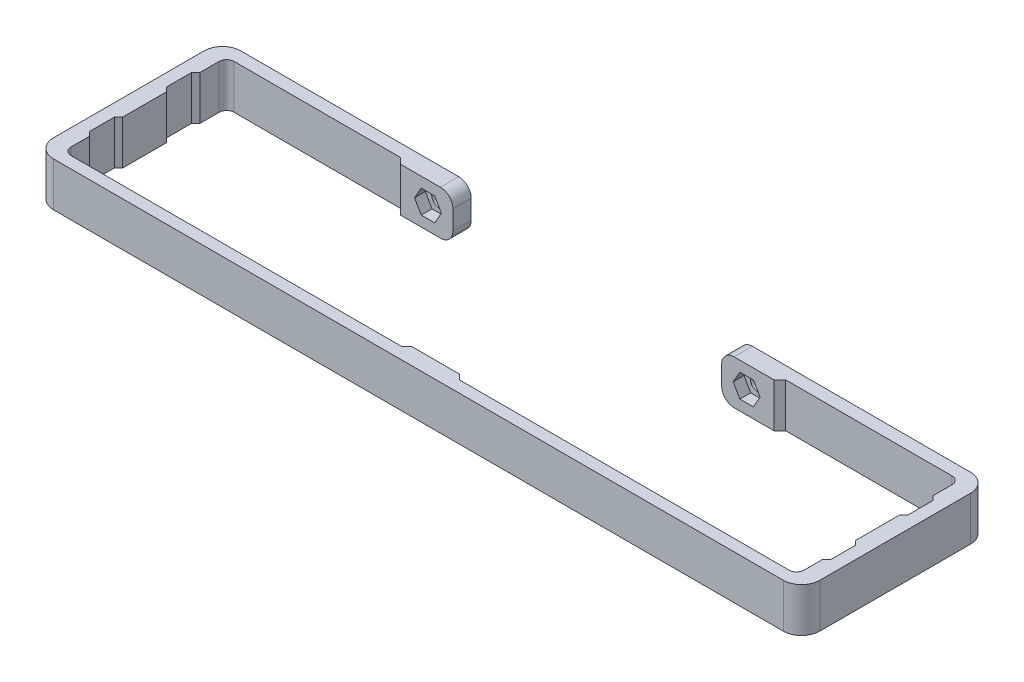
ISO-10303-21;
HEADER;
FILE_DESCRIPTION(('STEP AP214'),'2;1');
FILE_NAME('part.step','',(''),(''),'','','');
FILE_SCHEMA(('AUTOMOTIVE_DESIGN { 1 0 10303 214 1 1 1 1 }'));
ENDSEC;
DATA;
#1=APPLICATION_CONTEXT('core data for automotive mechanical design processes');
#2=APPLICATION_PROTOCOL_DEFINITION('international standard','automotive_design',2000,#1);
#3=PRODUCT_CONTEXT('',#1,'mechanical');
#4=PRODUCT('Part','Part','',(#3));
#5=PRODUCT_RELATED_PRODUCT_CATEGORY('part','',(#4));
#6=PRODUCT_DEFINITION_FORMATION('','',#4);
#7=PRODUCT_DEFINITION_CONTEXT('part definition',#1,'design');
#8=PRODUCT_DEFINITION('design','',#6,#7);
#9=PRODUCT_DEFINITION_SHAPE('','',#8);
#10=(LENGTH_UNIT() NAMED_UNIT(*) SI_UNIT(.MILLI.,.METRE.));
#11=(NAMED_UNIT(*) PLANE_ANGLE_UNIT() SI_UNIT($,.RADIAN.));
#12=(NAMED_UNIT(*) SI_UNIT($,.STERADIAN.) SOLID_ANGLE_UNIT());
#13=UNCERTAINTY_MEASURE_WITH_UNIT(LENGTH_MEASURE(1.E-05),#10,'distance_accuracy_value','');
#14=(GEOMETRIC_REPRESENTATION_CONTEXT(3) GLOBAL_UNCERTAINTY_ASSIGNED_CONTEXT((#13)) GLOBAL_UNIT_ASSIGNED_CONTEXT((#10,
#11,#12)) REPRESENTATION_CONTEXT('',''));
#15=CARTESIAN_POINT('',(0.,0.,0.));
#16=DIRECTION('',(0.,0.,1.));
#17=DIRECTION('',(1.,0.,0.));
#18=AXIS2_PLACEMENT_3D('',#15,#16,#17);
#19=CARTESIAN_POINT('',(117.397379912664,37.2165938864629,-41.));
#20=DIRECTION('',(1.,0.,0.));
#21=DIRECTION('',(0.,0.,-1.));
#22=AXIS2_PLACEMENT_3D('',#19,#20,#21);
#23=PLANE('',#22);
#24=DIRECTION('',(0.,0.,1.));
#25=VECTOR('',#24,1.);
#26=CARTESIAN_POINT('',(117.397379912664,47.8165938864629,-41.));
#27=LINE('',#26,#25);
#28=CARTESIAN_POINT('',(117.397379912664,47.8165938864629,-36.2));
#29=VERTEX_POINT('',#28);
#30=CARTESIAN_POINT('',(117.397379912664,47.8165938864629,-31.6));
#31=VERTEX_POINT('',#30);
#32=EDGE_CURVE('E568',#29,#31,#27,.T.);
#33=ORIENTED_EDGE('',*,*,#32,.F.);
#34=DIRECTION('',(0.,1.,0.));
#35=VECTOR('',#34,1.);
#36=CARTESIAN_POINT('',(117.397379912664,37.2165938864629,-36.2));
#37=LINE('',#36,#35);
#38=CARTESIAN_POINT('',(117.397379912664,37.2165938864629,-36.2));
#39=VERTEX_POINT('',#38);
#40=EDGE_CURVE('E776',#29,#39,#37,.F.);
#41=ORIENTED_EDGE('',*,*,#40,.T.);
#42=DIRECTION('',(0.,0.,1.));
#43=VECTOR('',#42,1.);
#44=CARTESIAN_POINT('',(117.397379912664,37.2165938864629,-41.));
#45=LINE('',#44,#43);
#46=CARTESIAN_POINT('',(117.397379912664,37.2165938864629,-31.6));
#47=VERTEX_POINT('',#46);
#48=EDGE_CURVE('E572',#39,#47,#45,.T.);
#49=ORIENTED_EDGE('',*,*,#48,.T.);
#50=DIRECTION('',(0.,-1.,0.));
#51=VECTOR('',#50,1.);
#52=CARTESIAN_POINT('',(117.397379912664,37.2165938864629,-31.6));
#53=LINE('',#52,#51);
#54=EDGE_CURVE('E675',#47,#31,#53,.F.);
#55=ORIENTED_EDGE('',*,*,#54,.T.);
#56=EDGE_LOOP('',(#33,#41,#49,#55));
#57=FACE_BOUND('',#56,.T.);
#58=ADVANCED_FACE('F33',(#57),#23,.F.);
#59=CARTESIAN_POINT('',(-58.8026200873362,37.2165938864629,-41.));
#60=DIRECTION('',(-1.,0.,0.));
#61=DIRECTION('',(0.,0.,1.));
#62=AXIS2_PLACEMENT_3D('',#59,#60,#61);
#63=PLANE('',#62);
#64=DIRECTION('',(0.,0.,1.));
#65=VECTOR('',#64,1.);
#66=CARTESIAN_POINT('',(-58.8026200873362,47.8165938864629,-41.));
#67=LINE('',#66,#65);
#68=CARTESIAN_POINT('',(-58.8026200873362,47.8165938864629,-5.00000000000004));
#69=VERTEX_POINT('',#68);
#70=CARTESIAN_POINT('',(-58.8026200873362,47.8165938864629,-0.599999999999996));
#71=VERTEX_POINT('',#70);
#72=EDGE_CURVE('E557',#69,#71,#67,.T.);
#73=ORIENTED_EDGE('',*,*,#72,.T.);
#74=DIRECTION('',(0.,1.,0.));
#75=VECTOR('',#74,1.);
#76=CARTESIAN_POINT('',(-58.8026200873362,37.2165938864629,-0.6));
#77=LINE('',#76,#75);
#78=CARTESIAN_POINT('',(-58.8026200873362,37.2165938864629,-0.599999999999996));
#79=VERTEX_POINT('',#78);
#80=EDGE_CURVE('E791',#71,#79,#77,.F.);
#81=ORIENTED_EDGE('',*,*,#80,.T.);
#82=DIRECTION('',(0.,0.,1.));
#83=VECTOR('',#82,1.);
#84=CARTESIAN_POINT('',(-58.8026200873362,37.2165938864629,-41.));
#85=LINE('',#84,#83);
#86=CARTESIAN_POINT('',(-58.8026200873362,37.2165938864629,-5.00000000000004));
#87=VERTEX_POINT('',#86);
#88=EDGE_CURVE('E554',#87,#79,#85,.T.);
#89=ORIENTED_EDGE('',*,*,#88,.F.);
#90=DIRECTION('',(0.,-1.,0.));
#91=VECTOR('',#90,1.);
#92=CARTESIAN_POINT('',(-58.8026200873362,37.2165938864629,-5.00000000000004));
#93=LINE('',#92,#91);
#94=EDGE_CURVE('E732',#87,#69,#93,.F.);
#95=ORIENTED_EDGE('',*,*,#94,.T.);
#96=EDGE_LOOP('',(#73,#81,#89,#95));
#97=FACE_BOUND('',#96,.T.);
#98=ADVANCED_FACE('F892',(#97),#63,.F.);
#99=CARTESIAN_POINT('',(-58.8026200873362,47.8165938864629,-23.6));
#100=VERTEX_POINT('',#99);
#101=CARTESIAN_POINT('',(-58.8026200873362,47.8165938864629,-13.));
#102=VERTEX_POINT('',#101);
#103=EDGE_CURVE('E562',#100,#102,#67,.T.);
#104=ORIENTED_EDGE('',*,*,#103,.T.);
#105=DIRECTION('',(0.,1.,0.));
#106=VECTOR('',#105,1.);
#107=CARTESIAN_POINT('',(-58.8026200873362,37.2165938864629,-13.));
#108=LINE('',#107,#106);
#109=CARTESIAN_POINT('',(-58.8026200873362,37.2165938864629,-13.));
#110=VERTEX_POINT('',#109);
#111=EDGE_CURVE('E727',#102,#110,#108,.F.);
#112=ORIENTED_EDGE('',*,*,#111,.T.);
#113=CARTESIAN_POINT('',(-58.8026200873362,37.2165938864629,-23.6));
#114=VERTEX_POINT('',#113);
#115=EDGE_CURVE('E558',#114,#110,#85,.T.);
#116=ORIENTED_EDGE('',*,*,#115,.F.);
#117=DIRECTION('',(0.,-1.,0.));
#118=VECTOR('',#117,1.);
#119=CARTESIAN_POINT('',(-58.8026200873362,37.2165938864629,-23.6));
#120=LINE('',#119,#118);
#121=EDGE_CURVE('E740',#114,#100,#120,.F.);
#122=ORIENTED_EDGE('',*,*,#121,.T.);
#123=EDGE_LOOP('',(#104,#112,#116,#122));
#124=FACE_BOUND('',#123,.T.);
#125=ADVANCED_FACE('F900',(#124),#63,.F.);
#126=CARTESIAN_POINT('',(117.397379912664,47.8165938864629,-23.6));
#127=VERTEX_POINT('',#126);
#128=CARTESIAN_POINT('',(117.397379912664,47.8165938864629,-13.));
#129=VERTEX_POINT('',#128);
#130=EDGE_CURVE('E571',#127,#129,#27,.T.);
#131=ORIENTED_EDGE('',*,*,#130,.F.);
#132=DIRECTION('',(0.,1.,0.));
#133=VECTOR('',#132,1.);
#134=CARTESIAN_POINT('',(117.397379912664,37.2165938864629,-23.6));
#135=LINE('',#134,#133);
#136=CARTESIAN_POINT('',(117.397379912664,37.2165938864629,-23.6));
#137=VERTEX_POINT('',#136);
#138=EDGE_CURVE('E702',#127,#137,#135,.F.);
#139=ORIENTED_EDGE('',*,*,#138,.T.);
#140=CARTESIAN_POINT('',(117.397379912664,37.2165938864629,-13.));
#141=VERTEX_POINT('',#140);
#142=EDGE_CURVE('E575',#137,#141,#45,.T.);
#143=ORIENTED_EDGE('',*,*,#142,.T.);
#144=DIRECTION('',(0.,-1.,0.));
#145=VECTOR('',#144,1.);
#146=CARTESIAN_POINT('',(117.397379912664,37.2165938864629,-13.));
#147=LINE('',#146,#145);
#148=EDGE_CURVE('E691',#141,#129,#147,.F.);
#149=ORIENTED_EDGE('',*,*,#148,.T.);
#150=EDGE_LOOP('',(#131,#139,#143,#149));
#151=FACE_BOUND('',#150,.T.);
#152=ADVANCED_FACE('F895',(#151),#23,.F.);
#153=CARTESIAN_POINT('',(67.5973799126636,42.5165938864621,-30.4));
#154=DIRECTION('',(0.,0.,-1.));
#155=DIRECTION('',(-1.,0.,0.));
#156=AXIS2_PLACEMENT_3D('',#153,#154,#155);
#157=CYLINDRICAL_SURFACE('',#156,1.70000000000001);
#158=CARTESIAN_POINT('',(67.5973799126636,42.5165938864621,-41.));
#159=DIRECTION('',(0.,0.,-1.));
#160=DIRECTION('',(-1.,0.,0.));
#161=AXIS2_PLACEMENT_3D('',#158,#159,#160);
#162=CIRCLE('',#161,1.70000000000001);
#163=CARTESIAN_POINT('',(65.8973799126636,42.5165938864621,-41.));
#164=VERTEX_POINT('',#163);
#165=EDGE_CURVE('E523',#164,#164,#162,.T.);
#166=ORIENTED_EDGE('',*,*,#165,.T.);
#167=EDGE_LOOP('',(#166));
#168=FACE_BOUND('',#167,.T.);
#169=CARTESIAN_POINT('',(67.5973799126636,42.5165938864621,-39.2));
#170=DIRECTION('',(0.,0.,1.));
#171=DIRECTION('',(1.,0.,0.));
#172=AXIS2_PLACEMENT_3D('',#169,#170,#171);
#173=CIRCLE('',#172,1.70000000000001);
#174=CARTESIAN_POINT('',(69.2973799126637,42.5165938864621,-39.2));
#175=VERTEX_POINT('',#174);
#176=EDGE_CURVE('E466',#175,#175,#173,.F.);
#177=ORIENTED_EDGE('',*,*,#176,.F.);
#178=EDGE_LOOP('',(#177));
#179=FACE_BOUND('',#178,.T.);
#180=ADVANCED_FACE('F908',(#168,#179),#157,.F.);
#181=CARTESIAN_POINT('',(-9.00262008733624,42.5165938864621,-30.4));
#182=DIRECTION('',(0.,0.,-1.));
#183=DIRECTION('',(-1.,0.,0.));
#184=AXIS2_PLACEMENT_3D('',#181,#182,#183);
#185=CYLINDRICAL_SURFACE('',#184,1.7);
#186=CARTESIAN_POINT('',(-9.00262008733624,42.5165938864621,-41.));
#187=DIRECTION('',(0.,0.,-1.));
#188=DIRECTION('',(-1.,0.,0.));
#189=AXIS2_PLACEMENT_3D('',#186,#187,#188);
#190=CIRCLE('',#189,1.7);
#191=CARTESIAN_POINT('',(-10.7026200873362,42.5165938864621,-41.));
#192=VERTEX_POINT('',#191);
#193=EDGE_CURVE('E526',#192,#192,#190,.T.);
#194=ORIENTED_EDGE('',*,*,#193,.T.);
#195=EDGE_LOOP('',(#194));
#196=FACE_BOUND('',#195,.T.);
#197=CARTESIAN_POINT('',(-9.00262008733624,42.5165938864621,-39.2));
#198=DIRECTION('',(0.,0.,1.));
#199=DIRECTION('',(1.,0.,0.));
#200=AXIS2_PLACEMENT_3D('',#197,#198,#199);
#201=CIRCLE('',#200,1.7);
#202=CARTESIAN_POINT('',(-7.30262008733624,42.5165938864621,-39.2));
#203=VERTEX_POINT('',#202);
#204=EDGE_CURVE('E512',#203,#203,#201,.F.);
#205=ORIENTED_EDGE('',*,*,#204,.F.);
#206=EDGE_LOOP('',(#205));
#207=FACE_BOUND('',#206,.T.);
#208=ADVANCED_FACE('F1141',(#196,#207),#185,.F.);
#209=CARTESIAN_POINT('',(0.,0.,0.));
#210=DIRECTION('',(0.,0.,1.));
#211=DIRECTION('',(1.,0.,0.));
#212=AXIS2_PLACEMENT_3D('',#209,#210,#211);
#213=PLANE('',#212);
#214=DIRECTION('',(1.,0.,0.));
#215=VECTOR('',#214,1.);
#216=CARTESIAN_POINT('',(-62.8026200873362,37.2165938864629,0.));
#217=LINE('',#216,#215);
#218=CARTESIAN_POINT('',(23.5973799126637,37.2165938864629,0.));
#219=VERTEX_POINT('',#218);
#220=CARTESIAN_POINT('',(35.1973799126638,37.2165938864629,0.));
#221=VERTEX_POINT('',#220);
#222=EDGE_CURVE('E574',#219,#221,#217,.T.);
#223=ORIENTED_EDGE('',*,*,#222,.F.);
#224=DIRECTION('',(0.,-1.,0.));
#225=VECTOR('',#224,1.);
#226=CARTESIAN_POINT('',(23.5973799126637,0.,0.));
#227=LINE('',#226,#225);
#228=CARTESIAN_POINT('',(23.5973799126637,47.8165938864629,0.));
#229=VERTEX_POINT('',#228);
#230=EDGE_CURVE('E715',#219,#229,#227,.F.);
#231=ORIENTED_EDGE('',*,*,#230,.T.);
#232=DIRECTION('',(-1.,0.,0.));
#233=VECTOR('',#232,1.);
#234=CARTESIAN_POINT('',(-62.8026200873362,47.8165938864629,0.));
#235=LINE('',#234,#233);
#236=CARTESIAN_POINT('',(35.1973799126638,47.8165938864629,0.));
#237=VERTEX_POINT('',#236);
#238=EDGE_CURVE('E580',#237,#229,#235,.T.);
#239=ORIENTED_EDGE('',*,*,#238,.F.);
#240=DIRECTION('',(0.,1.,0.));
#241=VECTOR('',#240,1.);
#242=CARTESIAN_POINT('',(35.1973799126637,0.,0.));
#243=LINE('',#242,#241);
#244=EDGE_CURVE('E710',#237,#221,#243,.F.);
#245=ORIENTED_EDGE('',*,*,#244,.T.);
#246=EDGE_LOOP('',(#223,#231,#239,#245));
#247=FACE_BOUND('',#246,.T.);
#248=ADVANCED_FACE('F1139',(#247),#213,.F.);
#249=CARTESIAN_POINT('',(-62.8026200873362,47.8165938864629,4.));
#250=DIRECTION('',(1.,0.,0.));
#251=DIRECTION('',(0.,1.,0.));
#252=AXIS2_PLACEMENT_3D('',#249,#250,#251);
#253=PLANE('',#252);
#254=DIRECTION('',(0.,0.,-1.));
#255=VECTOR('',#254,1.);
#256=CARTESIAN_POINT('',(-62.8026200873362,47.8165938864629,4.));
#257=LINE('',#256,#255);
#258=CARTESIAN_POINT('',(-62.8026200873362,47.8165938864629,-0.4));
#259=VERTEX_POINT('',#258);
#260=CARTESIAN_POINT('',(-62.8026200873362,47.8165938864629,-36.6));
#261=VERTEX_POINT('',#260);
#262=EDGE_CURVE('E583',#259,#261,#257,.T.);
#263=ORIENTED_EDGE('',*,*,#262,.T.);
#264=DIRECTION('',(0.,1.,0.));
#265=VECTOR('',#264,1.);
#266=CARTESIAN_POINT('',(-62.8026200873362,37.2165938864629,-36.6));
#267=LINE('',#266,#265);
#268=CARTESIAN_POINT('',(-62.8026200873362,37.2165938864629,-36.6));
#269=VERTEX_POINT('',#268);
#270=EDGE_CURVE('E627',#261,#269,#267,.F.);
#271=ORIENTED_EDGE('',*,*,#270,.T.);
#272=DIRECTION('',(0.,0.,-1.));
#273=VECTOR('',#272,1.);
#274=CARTESIAN_POINT('',(-62.8026200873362,37.2165938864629,4.));
#275=LINE('',#274,#273);
#276=CARTESIAN_POINT('',(-62.8026200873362,37.2165938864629,-0.4));
#277=VERTEX_POINT('',#276);
#278=EDGE_CURVE('E594',#277,#269,#275,.T.);
#279=ORIENTED_EDGE('',*,*,#278,.F.);
#280=DIRECTION('',(0.,-1.,0.));
#281=VECTOR('',#280,1.);
#282=CARTESIAN_POINT('',(-62.8026200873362,47.8165938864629,-0.4));
#283=LINE('',#282,#281);
#284=EDGE_CURVE('E625',#277,#259,#283,.F.);
#285=ORIENTED_EDGE('',*,*,#284,.T.);
#286=EDGE_LOOP('',(#263,#271,#279,#285));
#287=FACE_BOUND('',#286,.T.);
#288=ADVANCED_FACE('F1049',(#287),#253,.F.);
#289=CARTESIAN_POINT('',(-62.8026200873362,37.2165938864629,4.));
#290=DIRECTION('',(0.,1.,0.));
#291=DIRECTION('',(0.,0.,1.));
#292=AXIS2_PLACEMENT_3D('',#289,#290,#291);
#293=PLANE('',#292);
#294=DIRECTION('',(1.,0.,0.));
#295=VECTOR('',#294,1.);
#296=CARTESIAN_POINT('',(117.397379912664,37.2165938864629,-36.6));
#297=LINE('',#296,#295);
#298=CARTESIAN_POINT('',(64.5973799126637,37.2165938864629,-36.6));
#299=VERTEX_POINT('',#298);
#300=CARTESIAN_POINT('',(74.1973799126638,37.2165938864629,-36.6));
#301=VERTEX_POINT('',#300);
#302=EDGE_CURVE('E530',#299,#301,#297,.T.);
#303=ORIENTED_EDGE('',*,*,#302,.F.);
#304=DIRECTION('',(0.,0.,1.));
#305=VECTOR('',#304,1.);
#306=CARTESIAN_POINT('',(64.5973799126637,37.2165938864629,-41.));
#307=LINE('',#306,#305);
#308=CARTESIAN_POINT('',(64.5973799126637,37.2165938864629,-41.));
#309=VERTEX_POINT('',#308);
#310=EDGE_CURVE('E820',#299,#309,#307,.F.);
#311=ORIENTED_EDGE('',*,*,#310,.T.);
#312=DIRECTION('',(-1.,0.,0.));
#313=VECTOR('',#312,1.);
#314=CARTESIAN_POINT('',(121.397379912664,37.2165938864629,-41.));
#315=LINE('',#314,#313);
#316=CARTESIAN_POINT('',(116.997379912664,37.2165938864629,-41.));
#317=VERTEX_POINT('',#316);
#318=EDGE_CURVE('E561',#317,#309,#315,.T.);
#319=ORIENTED_EDGE('',*,*,#318,.F.);
#320=CARTESIAN_POINT('',(116.997379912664,37.2165938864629,-36.6));
#321=DIRECTION('',(0.,1.,0.));
#322=DIRECTION('',(0.,0.,1.));
#323=AXIS2_PLACEMENT_3D('',#320,#321,#322);
#324=CIRCLE('',#323,4.4);
#325=CARTESIAN_POINT('',(121.397379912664,37.2165938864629,-36.6));
#326=VERTEX_POINT('',#325);
#327=EDGE_CURVE('E607',#317,#326,#324,.F.);
#328=ORIENTED_EDGE('',*,*,#327,.T.);
#329=DIRECTION('',(0.,0.,-1.));
#330=VECTOR('',#329,1.);
#331=CARTESIAN_POINT('',(121.397379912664,37.2165938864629,4.));
#332=LINE('',#331,#330);
#333=CARTESIAN_POINT('',(121.397379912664,37.2165938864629,-0.4));
#334=VERTEX_POINT('',#333);
#335=EDGE_CURVE('E591',#334,#326,#332,.T.);
#336=ORIENTED_EDGE('',*,*,#335,.F.);
#337=CARTESIAN_POINT('',(116.997379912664,37.2165938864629,-0.4));
#338=DIRECTION('',(0.,1.,0.));
#339=DIRECTION('',(0.,0.,1.));
#340=AXIS2_PLACEMENT_3D('',#337,#338,#339);
#341=CIRCLE('',#340,4.4);
#342=CARTESIAN_POINT('',(116.997379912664,37.2165938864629,4.));
#343=VERTEX_POINT('',#342);
#344=EDGE_CURVE('E600',#334,#343,#341,.F.);
#345=ORIENTED_EDGE('',*,*,#344,.T.);
#346=DIRECTION('',(1.,0.,0.));
#347=VECTOR('',#346,1.);
#348=CARTESIAN_POINT('',(-62.8026200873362,37.2165938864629,4.));
#349=LINE('',#348,#347);
#350=CARTESIAN_POINT('',(-58.4026200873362,37.2165938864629,4.));
#351=VERTEX_POINT('',#350);
#352=EDGE_CURVE('E576',#351,#343,#349,.T.);
#353=ORIENTED_EDGE('',*,*,#352,.F.);
#354=CARTESIAN_POINT('',(-58.4026200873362,37.2165938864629,-0.4));
#355=DIRECTION('',(0.,1.,0.));
#356=DIRECTION('',(0.,0.,1.));
#357=AXIS2_PLACEMENT_3D('',#354,#355,#356);
#358=CIRCLE('',#357,4.4);
#359=EDGE_CURVE('E602',#351,#277,#358,.F.);
#360=ORIENTED_EDGE('',*,*,#359,.T.);
#361=ORIENTED_EDGE('',*,*,#278,.T.);
#362=CARTESIAN_POINT('',(-58.4026200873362,37.2165938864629,-36.6));
#363=DIRECTION('',(0.,1.,0.));
#364=DIRECTION('',(0.,0.,1.));
#365=AXIS2_PLACEMENT_3D('',#362,#363,#364);
#366=CIRCLE('',#365,4.4);
#367=CARTESIAN_POINT('',(-58.4026200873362,37.2165938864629,-41.));
#368=VERTEX_POINT('',#367);
#369=EDGE_CURVE('E604',#269,#368,#366,.F.);
#370=ORIENTED_EDGE('',*,*,#369,.T.);
#371=DIRECTION('',(-1.,0.,0.));
#372=VECTOR('',#371,1.);
#373=CARTESIAN_POINT('',(-62.8026200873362,37.2165938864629,-41.));
#374=LINE('',#373,#372);
#375=CARTESIAN_POINT('',(-6.00262008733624,37.2165938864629,-41.));
#376=VERTEX_POINT('',#375);
#377=EDGE_CURVE('E552',#376,#368,#374,.T.);
#378=ORIENTED_EDGE('',*,*,#377,.F.);
#379=DIRECTION('',(0.,0.,-1.));
#380=VECTOR('',#379,1.);
#381=CARTESIAN_POINT('',(-6.00262008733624,37.2165938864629,-36.6));
#382=LINE('',#381,#380);
#383=CARTESIAN_POINT('',(-6.00262008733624,37.2165938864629,-36.6));
#384=VERTEX_POINT('',#383);
#385=EDGE_CURVE('E818',#376,#384,#382,.F.);
#386=ORIENTED_EDGE('',*,*,#385,.T.);
#387=DIRECTION('',(1.,0.,0.));
#388=VECTOR('',#387,1.);
#389=CARTESIAN_POINT('',(-58.8026200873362,37.2165938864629,-36.6));
#390=LINE('',#389,#388);
#391=CARTESIAN_POINT('',(-15.6026200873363,37.2165938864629,-36.6));
#392=VERTEX_POINT('',#391);
#393=EDGE_CURVE('E540',#392,#384,#390,.T.);
#394=ORIENTED_EDGE('',*,*,#393,.F.);
#395=DIRECTION('',(0.707106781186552,0.,0.707106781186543));
#396=VECTOR('',#395,1.);
#397=CARTESIAN_POINT('',(-18.9026200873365,37.2165938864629,-39.9000000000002));
#398=LINE('',#397,#396);
#399=CARTESIAN_POINT('',(-17.0026200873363,37.2165938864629,-38.));
#400=VERTEX_POINT('',#399);
#401=EDGE_CURVE('E771',#392,#400,#398,.F.);
#402=ORIENTED_EDGE('',*,*,#401,.T.);
#403=DIRECTION('',(-1.,0.,0.));
#404=VECTOR('',#403,1.);
#405=CARTESIAN_POINT('',(-62.8026200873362,37.2165938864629,-38.));
#406=LINE('',#405,#404);
#407=CARTESIAN_POINT('',(-57.0026200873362,37.2165938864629,-38.));
#408=VERTEX_POINT('',#407);
#409=EDGE_CURVE('E865',#400,#408,#406,.T.);
#410=ORIENTED_EDGE('',*,*,#409,.T.);
#411=CARTESIAN_POINT('',(-57.0026200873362,37.2165938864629,-36.2));
#412=DIRECTION('',(0.,1.,0.));
#413=DIRECTION('',(0.,0.,1.));
#414=AXIS2_PLACEMENT_3D('',#411,#412,#413);
#415=CIRCLE('',#414,1.8);
#416=CARTESIAN_POINT('',(-58.8026200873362,37.2165938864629,-36.2));
#417=VERTEX_POINT('',#416);
#418=EDGE_CURVE('E803',#408,#417,#415,.T.);
#419=ORIENTED_EDGE('',*,*,#418,.T.);
#420=CARTESIAN_POINT('',(-58.8026200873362,37.2165938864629,-31.6));
#421=VERTEX_POINT('',#420);
#422=EDGE_CURVE('E555',#417,#421,#85,.T.);
#423=ORIENTED_EDGE('',*,*,#422,.T.);
#424=DIRECTION('',(0.707106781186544,0.,-0.707106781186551));
#425=VECTOR('',#424,1.);
#426=CARTESIAN_POINT('',(-78.6026200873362,37.2165938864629,-11.7999999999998));
#427=LINE('',#426,#425);
#428=CARTESIAN_POINT('',(-59.8026200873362,37.2165938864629,-30.6));
#429=VERTEX_POINT('',#428);
#430=EDGE_CURVE('E754',#421,#429,#427,.F.);
#431=ORIENTED_EDGE('',*,*,#430,.T.);
#432=DIRECTION('',(0.,0.,1.));
#433=VECTOR('',#432,1.);
#434=CARTESIAN_POINT('',(-59.8026200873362,37.2165938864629,4.));
#435=LINE('',#434,#433);
#436=CARTESIAN_POINT('',(-59.8026200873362,37.2165938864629,-24.6));
#437=VERTEX_POINT('',#436);
#438=EDGE_CURVE('E947',#429,#437,#435,.T.);
#439=ORIENTED_EDGE('',*,*,#438,.T.);
#440=DIRECTION('',(-0.707106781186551,0.,-0.707106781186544));
#441=VECTOR('',#440,1.);
#442=CARTESIAN_POINT('',(-47.0026200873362,37.2165938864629,-11.8000000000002));
#443=LINE('',#442,#441);
#444=EDGE_CURVE('E745',#437,#114,#443,.F.);
#445=ORIENTED_EDGE('',*,*,#444,.T.);
#446=ORIENTED_EDGE('',*,*,#115,.T.);
#447=DIRECTION('',(0.707106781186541,0.,-0.707106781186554));
#448=VECTOR('',#447,1.);
#449=CARTESIAN_POINT('',(-69.3026200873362,37.2165938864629,-2.49999999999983));
#450=LINE('',#449,#448);
#451=CARTESIAN_POINT('',(-59.8026200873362,37.2165938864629,-12.));
#452=VERTEX_POINT('',#451);
#453=EDGE_CURVE('E730',#110,#452,#450,.F.);
#454=ORIENTED_EDGE('',*,*,#453,.T.);
#455=DIRECTION('',(0.,0.,1.));
#456=VECTOR('',#455,1.);
#457=CARTESIAN_POINT('',(-59.8026200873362,37.2165938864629,4.));
#458=LINE('',#457,#456);
#459=CARTESIAN_POINT('',(-59.8026200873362,37.2165938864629,-6.00000000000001));
#460=VERTEX_POINT('',#459);
#461=EDGE_CURVE('E955',#452,#460,#458,.T.);
#462=ORIENTED_EDGE('',*,*,#461,.T.);
#463=DIRECTION('',(-0.707106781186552,0.,-0.707106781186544));
#464=VECTOR('',#463,1.);
#465=CARTESIAN_POINT('',(-56.3026200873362,37.2165938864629,-2.50000000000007));
#466=LINE('',#465,#464);
#467=EDGE_CURVE('E737',#460,#87,#466,.F.);
#468=ORIENTED_EDGE('',*,*,#467,.T.);
#469=ORIENTED_EDGE('',*,*,#88,.T.);
#470=CARTESIAN_POINT('',(-57.0026200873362,37.2165938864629,-0.6));
#471=DIRECTION('',(0.,1.,0.));
#472=DIRECTION('',(0.,0.,1.));
#473=AXIS2_PLACEMENT_3D('',#470,#471,#472);
#474=CIRCLE('',#473,1.8);
#475=CARTESIAN_POINT('',(-57.0026200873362,37.2165938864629,1.2));
#476=VERTEX_POINT('',#475);
#477=EDGE_CURVE('E807',#79,#476,#474,.T.);
#478=ORIENTED_EDGE('',*,*,#477,.T.);
#479=DIRECTION('',(1.,0.,0.));
#480=VECTOR('',#479,1.);
#481=CARTESIAN_POINT('',(-62.8026200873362,37.2165938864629,1.2));
#482=LINE('',#481,#480);
#483=CARTESIAN_POINT('',(22.3973799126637,37.2165938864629,1.2));
#484=VERTEX_POINT('',#483);
#485=EDGE_CURVE('E937',#476,#484,#482,.T.);
#486=ORIENTED_EDGE('',*,*,#485,.T.);
#487=DIRECTION('',(-0.707106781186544,0.,0.707106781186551));
#488=VECTOR('',#487,1.);
#489=CARTESIAN_POINT('',(-21.6026200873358,37.2165938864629,45.2));
#490=LINE('',#489,#488);
#491=EDGE_CURVE('E721',#484,#219,#490,.F.);
#492=ORIENTED_EDGE('',*,*,#491,.T.);
#493=ORIENTED_EDGE('',*,*,#222,.T.);
#494=DIRECTION('',(-0.707106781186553,0.,-0.707106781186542));
#495=VECTOR('',#494,1.);
#496=CARTESIAN_POINT('',(-11.802620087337,37.2165938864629,-47.));
#497=LINE('',#496,#495);
#498=CARTESIAN_POINT('',(36.3973799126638,37.2165938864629,1.20000000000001));
#499=VERTEX_POINT('',#498);
#500=EDGE_CURVE('E713',#221,#499,#497,.F.);
#501=ORIENTED_EDGE('',*,*,#500,.T.);
#502=DIRECTION('',(1.,0.,0.));
#503=VECTOR('',#502,1.);
#504=CARTESIAN_POINT('',(-62.8026200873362,37.2165938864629,1.20000000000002));
#505=LINE('',#504,#503);
#506=CARTESIAN_POINT('',(115.597379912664,37.2165938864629,1.2));
#507=VERTEX_POINT('',#506);
#508=EDGE_CURVE('E936',#499,#507,#505,.T.);
#509=ORIENTED_EDGE('',*,*,#508,.T.);
#510=CARTESIAN_POINT('',(115.597379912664,37.2165938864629,-0.599999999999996));
#511=DIRECTION('',(0.,1.,0.));
#512=DIRECTION('',(0.,0.,1.));
#513=AXIS2_PLACEMENT_3D('',#510,#511,#512);
#514=CIRCLE('',#513,1.8);
#515=CARTESIAN_POINT('',(117.397379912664,37.2165938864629,-0.599999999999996));
#516=VERTEX_POINT('',#515);
#517=EDGE_CURVE('E799',#507,#516,#514,.T.);
#518=ORIENTED_EDGE('',*,*,#517,.T.);
#519=CARTESIAN_POINT('',(117.397379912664,37.2165938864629,-5.00000000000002));
#520=VERTEX_POINT('',#519);
#521=EDGE_CURVE('E570',#520,#516,#45,.T.);
#522=ORIENTED_EDGE('',*,*,#521,.F.);
#523=DIRECTION('',(-0.707106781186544,0.,0.707106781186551));
#524=VECTOR('',#523,1.);
#525=CARTESIAN_POINT('',(22.7973799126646,37.2165938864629,89.6));
#526=LINE('',#525,#524);
#527=CARTESIAN_POINT('',(118.397379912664,37.2165938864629,-6.00000000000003));
#528=VERTEX_POINT('',#527);
#529=EDGE_CURVE('E689',#520,#528,#526,.F.);
#530=ORIENTED_EDGE('',*,*,#529,.T.);
#531=DIRECTION('',(0.,0.,-1.));
#532=VECTOR('',#531,1.);
#533=CARTESIAN_POINT('',(118.397379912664,37.2165938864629,4.));
#534=LINE('',#533,#532);
#535=CARTESIAN_POINT('',(118.397379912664,37.2165938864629,-12.));
#536=VERTEX_POINT('',#535);
#537=EDGE_CURVE('E443',#528,#536,#534,.T.);
#538=ORIENTED_EDGE('',*,*,#537,.T.);
#539=DIRECTION('',(0.70710678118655,0.,0.707106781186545));
#540=VECTOR('',#539,1.);
#541=CARTESIAN_POINT('',(35.797379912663,37.2165938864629,-94.6000000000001));
#542=LINE('',#541,#540);
#543=EDGE_CURVE('E696',#536,#141,#542,.F.);
#544=ORIENTED_EDGE('',*,*,#543,.T.);
#545=ORIENTED_EDGE('',*,*,#142,.F.);
#546=DIRECTION('',(-0.707106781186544,0.,0.707106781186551));
#547=VECTOR('',#546,1.);
#548=CARTESIAN_POINT('',(13.4973799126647,37.2165938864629,80.3000000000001));
#549=LINE('',#548,#547);
#550=CARTESIAN_POINT('',(118.397379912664,37.2165938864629,-24.6));
#551=VERTEX_POINT('',#550);
#552=EDGE_CURVE('E705',#137,#551,#549,.F.);
#553=ORIENTED_EDGE('',*,*,#552,.T.);
#554=DIRECTION('',(0.,0.,-1.));
#555=VECTOR('',#554,1.);
#556=CARTESIAN_POINT('',(118.397379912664,37.2165938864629,4.));
#557=LINE('',#556,#555);
#558=CARTESIAN_POINT('',(118.397379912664,37.2165938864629,-30.6));
#559=VERTEX_POINT('',#558);
#560=EDGE_CURVE('E958',#551,#559,#557,.T.);
#561=ORIENTED_EDGE('',*,*,#560,.T.);
#562=DIRECTION('',(0.70710678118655,0.,0.707106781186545));
#563=VECTOR('',#562,1.);
#564=CARTESIAN_POINT('',(45.0973799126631,37.2165938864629,-103.9));
#565=LINE('',#564,#563);
#566=EDGE_CURVE('E680',#559,#47,#565,.F.);
#567=ORIENTED_EDGE('',*,*,#566,.T.);
#568=ORIENTED_EDGE('',*,*,#48,.F.);
#569=CARTESIAN_POINT('',(115.597379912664,37.2165938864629,-36.2));
#570=DIRECTION('',(0.,1.,0.));
#571=DIRECTION('',(0.,0.,1.));
#572=AXIS2_PLACEMENT_3D('',#569,#570,#571);
#573=CIRCLE('',#572,1.8);
#574=CARTESIAN_POINT('',(115.597379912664,37.2165938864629,-38.));
#575=VERTEX_POINT('',#574);
#576=EDGE_CURVE('E795',#39,#575,#573,.T.);
#577=ORIENTED_EDGE('',*,*,#576,.T.);
#578=DIRECTION('',(-1.,0.,0.));
#579=VECTOR('',#578,1.);
#580=CARTESIAN_POINT('',(-62.8026200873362,37.2165938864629,-38.));
#581=LINE('',#580,#579);
#582=CARTESIAN_POINT('',(75.5973799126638,37.2165938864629,-38.));
#583=VERTEX_POINT('',#582);
#584=EDGE_CURVE('E873',#575,#583,#581,.T.);
#585=ORIENTED_EDGE('',*,*,#584,.T.);
#586=DIRECTION('',(0.707106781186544,0.,-0.707106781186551));
#587=VECTOR('',#586,1.);
#588=CARTESIAN_POINT('',(-14.6026200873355,37.2165938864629,52.2000000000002));
#589=LINE('',#588,#587);
#590=EDGE_CURVE('E762',#583,#301,#589,.F.);
#591=ORIENTED_EDGE('',*,*,#590,.T.);
#592=EDGE_LOOP('',(#303,#311,#319,#328,#336,#345,#353,#360,#361,#370,#378,#386,#394,#402,#410,
#419,#423,#431,#439,#445,#446,#454,#462,#468,#469,#478,#486,#492,#493,#501,#509,#518,#522,#530,
#538,#544,#545,#553,#561,#567,#568,#577,#585,#591));
#593=FACE_BOUND('',#592,.T.);
#594=ADVANCED_FACE('F857',(#593),#293,.F.);
#595=CARTESIAN_POINT('',(121.397379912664,47.8165938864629,4.));
#596=DIRECTION('',(-1.,0.,0.));
#597=DIRECTION('',(0.,0.,1.));
#598=AXIS2_PLACEMENT_3D('',#595,#596,#597);
#599=PLANE('',#598);
#600=ORIENTED_EDGE('',*,*,#335,.T.);
#601=DIRECTION('',(0.,-1.,0.));
#602=VECTOR('',#601,1.);
#603=CARTESIAN_POINT('',(121.397379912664,47.8165938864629,-36.6));
#604=LINE('',#603,#602);
#605=CARTESIAN_POINT('',(121.397379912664,47.8165938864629,-36.6));
#606=VERTEX_POINT('',#605);
#607=EDGE_CURVE('E611',#326,#606,#604,.F.);
#608=ORIENTED_EDGE('',*,*,#607,.T.);
#609=DIRECTION('',(0.,0.,-1.));
#610=VECTOR('',#609,1.);
#611=CARTESIAN_POINT('',(121.397379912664,47.8165938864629,4.));
#612=LINE('',#611,#610);
#613=CARTESIAN_POINT('',(121.397379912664,47.8165938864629,-0.4));
#614=VERTEX_POINT('',#613);
#615=EDGE_CURVE('E588',#614,#606,#612,.T.);
#616=ORIENTED_EDGE('',*,*,#615,.F.);
#617=DIRECTION('',(0.,1.,0.));
#618=VECTOR('',#617,1.);
#619=CARTESIAN_POINT('',(121.397379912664,37.2165938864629,-0.4));
#620=LINE('',#619,#618);
#621=EDGE_CURVE('E609',#614,#334,#620,.F.);
#622=ORIENTED_EDGE('',*,*,#621,.T.);
#623=EDGE_LOOP('',(#600,#608,#616,#622));
#624=FACE_BOUND('',#623,.T.);
#625=ADVANCED_FACE('F1035',(#624),#599,.F.);
#626=CARTESIAN_POINT('',(-62.8026200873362,47.8165938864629,4.));
#627=DIRECTION('',(0.,-1.,0.));
#628=DIRECTION('',(0.,0.,-1.));
#629=AXIS2_PLACEMENT_3D('',#626,#627,#628);
#630=PLANE('',#629);
#631=DIRECTION('',(1.,0.,0.));
#632=VECTOR('',#631,1.);
#633=CARTESIAN_POINT('',(121.397379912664,47.8165938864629,-41.));
#634=LINE('',#633,#632);
#635=CARTESIAN_POINT('',(64.5973799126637,47.8165938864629,-41.));
#636=VERTEX_POINT('',#635);
#637=CARTESIAN_POINT('',(116.997379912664,47.8165938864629,-41.));
#638=VERTEX_POINT('',#637);
#639=EDGE_CURVE('E565',#636,#638,#634,.T.);
#640=ORIENTED_EDGE('',*,*,#639,.F.);
#641=DIRECTION('',(0.,0.,1.));
#642=VECTOR('',#641,1.);
#643=CARTESIAN_POINT('',(64.5973799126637,47.8165938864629,-36.6));
#644=LINE('',#643,#642);
#645=CARTESIAN_POINT('',(64.5973799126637,47.8165938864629,-36.6));
#646=VERTEX_POINT('',#645);
#647=EDGE_CURVE('E829',#636,#646,#644,.T.);
#648=ORIENTED_EDGE('',*,*,#647,.T.);
#649=DIRECTION('',(1.,0.,0.));
#650=VECTOR('',#649,1.);
#651=CARTESIAN_POINT('',(117.397379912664,47.8165938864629,-36.6));
#652=LINE('',#651,#650);
#653=CARTESIAN_POINT('',(74.1973799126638,47.8165938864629,-36.6));
#654=VERTEX_POINT('',#653);
#655=EDGE_CURVE('E529',#646,#654,#652,.T.);
#656=ORIENTED_EDGE('',*,*,#655,.T.);
#657=DIRECTION('',(-0.707106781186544,0.,0.707106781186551));
#658=VECTOR('',#657,1.);
#659=CARTESIAN_POINT('',(-14.6026200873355,47.8165938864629,52.2000000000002));
#660=LINE('',#659,#658);
#661=CARTESIAN_POINT('',(75.5973799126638,47.8165938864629,-38.));
#662=VERTEX_POINT('',#661);
#663=EDGE_CURVE('E759',#654,#662,#660,.F.);
#664=ORIENTED_EDGE('',*,*,#663,.T.);
#665=DIRECTION('',(-1.,0.,0.));
#666=VECTOR('',#665,1.);
#667=CARTESIAN_POINT('',(117.397379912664,47.8165938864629,-38.));
#668=LINE('',#667,#666);
#669=CARTESIAN_POINT('',(115.597379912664,47.8165938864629,-38.));
#670=VERTEX_POINT('',#669);
#671=EDGE_CURVE('E997',#670,#662,#668,.T.);
#672=ORIENTED_EDGE('',*,*,#671,.F.);
#673=CARTESIAN_POINT('',(115.597379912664,47.8165938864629,-36.2));
#674=DIRECTION('',(0.,-1.,0.));
#675=DIRECTION('',(0.,0.,-1.));
#676=AXIS2_PLACEMENT_3D('',#673,#674,#675);
#677=CIRCLE('',#676,1.8);
#678=EDGE_CURVE('E793',#670,#29,#677,.T.);
#679=ORIENTED_EDGE('',*,*,#678,.T.);
#680=ORIENTED_EDGE('',*,*,#32,.T.);
#681=DIRECTION('',(-0.70710678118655,0.,-0.707106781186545));
#682=VECTOR('',#681,1.);
#683=CARTESIAN_POINT('',(45.0973799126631,47.8165938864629,-103.9));
#684=LINE('',#683,#682);
#685=CARTESIAN_POINT('',(118.397379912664,47.8165938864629,-30.6));
#686=VERTEX_POINT('',#685);
#687=EDGE_CURVE('E678',#31,#686,#684,.F.);
#688=ORIENTED_EDGE('',*,*,#687,.T.);
#689=DIRECTION('',(0.,0.,-1.));
#690=VECTOR('',#689,1.);
#691=CARTESIAN_POINT('',(118.397379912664,47.8165938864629,-32.6));
#692=LINE('',#691,#690);
#693=CARTESIAN_POINT('',(118.397379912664,47.8165938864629,-24.6));
#694=VERTEX_POINT('',#693);
#695=EDGE_CURVE('E944',#694,#686,#692,.T.);
#696=ORIENTED_EDGE('',*,*,#695,.F.);
#697=DIRECTION('',(0.707106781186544,0.,-0.707106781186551));
#698=VECTOR('',#697,1.);
#699=CARTESIAN_POINT('',(13.4973799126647,47.8165938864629,80.3000000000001));
#700=LINE('',#699,#698);
#701=EDGE_CURVE('E699',#694,#127,#700,.F.);
#702=ORIENTED_EDGE('',*,*,#701,.T.);
#703=ORIENTED_EDGE('',*,*,#130,.T.);
#704=DIRECTION('',(-0.70710678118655,0.,-0.707106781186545));
#705=VECTOR('',#704,1.);
#706=CARTESIAN_POINT('',(35.797379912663,47.8165938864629,-94.6));
#707=LINE('',#706,#705);
#708=CARTESIAN_POINT('',(118.397379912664,47.8165938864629,-12.));
#709=VERTEX_POINT('',#708);
#710=EDGE_CURVE('E694',#129,#709,#707,.F.);
#711=ORIENTED_EDGE('',*,*,#710,.T.);
#712=DIRECTION('',(0.,0.,-1.));
#713=VECTOR('',#712,1.);
#714=CARTESIAN_POINT('',(118.397379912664,47.8165938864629,-4.));
#715=LINE('',#714,#713);
#716=CARTESIAN_POINT('',(118.397379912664,47.8165938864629,-6.00000000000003));
#717=VERTEX_POINT('',#716);
#718=EDGE_CURVE('E960',#717,#709,#715,.T.);
#719=ORIENTED_EDGE('',*,*,#718,.F.);
#720=DIRECTION('',(0.707106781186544,0.,-0.707106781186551));
#721=VECTOR('',#720,1.);
#722=CARTESIAN_POINT('',(22.7973799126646,47.8165938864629,89.6));
#723=LINE('',#722,#721);
#724=CARTESIAN_POINT('',(117.397379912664,47.8165938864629,-5.00000000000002));
#725=VERTEX_POINT('',#724);
#726=EDGE_CURVE('E683',#717,#725,#723,.F.);
#727=ORIENTED_EDGE('',*,*,#726,.T.);
#728=CARTESIAN_POINT('',(117.397379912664,47.8165938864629,-0.599999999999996));
#729=VERTEX_POINT('',#728);
#730=EDGE_CURVE('E567',#725,#729,#27,.T.);
#731=ORIENTED_EDGE('',*,*,#730,.T.);
#732=CARTESIAN_POINT('',(115.597379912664,47.8165938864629,-0.599999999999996));
#733=DIRECTION('',(0.,-1.,0.));
#734=DIRECTION('',(0.,0.,-1.));
#735=AXIS2_PLACEMENT_3D('',#732,#733,#734);
#736=CIRCLE('',#735,1.8);
#737=CARTESIAN_POINT('',(115.597379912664,47.8165938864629,1.2));
#738=VERTEX_POINT('',#737);
#739=EDGE_CURVE('E797',#729,#738,#736,.T.);
#740=ORIENTED_EDGE('',*,*,#739,.T.);
#741=DIRECTION('',(1.,0.,0.));
#742=VECTOR('',#741,1.);
#743=CARTESIAN_POINT('',(117.397379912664,47.8165938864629,1.2));
#744=LINE('',#743,#742);
#745=CARTESIAN_POINT('',(36.3973799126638,47.8165938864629,1.20000000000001));
#746=VERTEX_POINT('',#745);
#747=EDGE_CURVE('E930',#746,#738,#744,.T.);
#748=ORIENTED_EDGE('',*,*,#747,.F.);
#749=DIRECTION('',(0.707106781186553,0.,0.707106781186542));
#750=VECTOR('',#749,1.);
#751=CARTESIAN_POINT('',(-11.8026200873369,47.8165938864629,-47.));
#752=LINE('',#751,#750);
#753=EDGE_CURVE('E707',#746,#237,#752,.F.);
#754=ORIENTED_EDGE('',*,*,#753,.T.);
#755=ORIENTED_EDGE('',*,*,#238,.T.);
#756=DIRECTION('',(0.707106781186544,0.,-0.707106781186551));
#757=VECTOR('',#756,1.);
#758=CARTESIAN_POINT('',(-21.6026200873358,47.8165938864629,45.2));
#759=LINE('',#758,#757);
#760=CARTESIAN_POINT('',(22.3973799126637,47.8165938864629,1.2));
#761=VERTEX_POINT('',#760);
#762=EDGE_CURVE('E718',#229,#761,#759,.F.);
#763=ORIENTED_EDGE('',*,*,#762,.T.);
#764=DIRECTION('',(1.,0.,0.));
#765=VECTOR('',#764,1.);
#766=CARTESIAN_POINT('',(-58.8026200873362,47.8165938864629,1.2));
#767=LINE('',#766,#765);
#768=CARTESIAN_POINT('',(-57.0026200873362,47.8165938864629,1.2));
#769=VERTEX_POINT('',#768);
#770=EDGE_CURVE('E874',#769,#761,#767,.T.);
#771=ORIENTED_EDGE('',*,*,#770,.F.);
#772=CARTESIAN_POINT('',(-57.0026200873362,47.8165938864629,-0.6));
#773=DIRECTION('',(0.,-1.,0.));
#774=DIRECTION('',(0.,0.,-1.));
#775=AXIS2_PLACEMENT_3D('',#772,#773,#774);
#776=CIRCLE('',#775,1.8);
#777=EDGE_CURVE('E805',#769,#71,#776,.T.);
#778=ORIENTED_EDGE('',*,*,#777,.T.);
#779=ORIENTED_EDGE('',*,*,#72,.F.);
#780=DIRECTION('',(0.707106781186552,0.,0.707106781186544));
#781=VECTOR('',#780,1.);
#782=CARTESIAN_POINT('',(-56.3026200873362,47.8165938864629,-2.50000000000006));
#783=LINE('',#782,#781);
#784=CARTESIAN_POINT('',(-59.8026200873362,47.8165938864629,-6.00000000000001));
#785=VERTEX_POINT('',#784);
#786=EDGE_CURVE('E735',#69,#785,#783,.F.);
#787=ORIENTED_EDGE('',*,*,#786,.T.);
#788=DIRECTION('',(0.,0.,1.));
#789=VECTOR('',#788,1.);
#790=CARTESIAN_POINT('',(-59.8026200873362,47.8165938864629,-4.));
#791=LINE('',#790,#789);
#792=CARTESIAN_POINT('',(-59.8026200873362,47.8165938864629,-12.));
#793=VERTEX_POINT('',#792);
#794=EDGE_CURVE('E948',#793,#785,#791,.T.);
#795=ORIENTED_EDGE('',*,*,#794,.F.);
#796=DIRECTION('',(-0.707106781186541,0.,0.707106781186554));
#797=VECTOR('',#796,1.);
#798=CARTESIAN_POINT('',(-69.3026200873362,47.8165938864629,-2.49999999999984));
#799=LINE('',#798,#797);
#800=EDGE_CURVE('E724',#793,#102,#799,.F.);
#801=ORIENTED_EDGE('',*,*,#800,.T.);
#802=ORIENTED_EDGE('',*,*,#103,.F.);
#803=DIRECTION('',(0.707106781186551,0.,0.707106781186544));
#804=VECTOR('',#803,1.);
#805=CARTESIAN_POINT('',(-47.0026200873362,47.8165938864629,-11.8000000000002));
#806=LINE('',#805,#804);
#807=CARTESIAN_POINT('',(-59.8026200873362,47.8165938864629,-24.6));
#808=VERTEX_POINT('',#807);
#809=EDGE_CURVE('E743',#100,#808,#806,.F.);
#810=ORIENTED_EDGE('',*,*,#809,.T.);
#811=DIRECTION('',(0.,0.,1.));
#812=VECTOR('',#811,1.);
#813=CARTESIAN_POINT('',(-59.8026200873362,47.8165938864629,-32.6));
#814=LINE('',#813,#812);
#815=CARTESIAN_POINT('',(-59.8026200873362,47.8165938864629,-30.6));
#816=VERTEX_POINT('',#815);
#817=EDGE_CURVE('E939',#816,#808,#814,.T.);
#818=ORIENTED_EDGE('',*,*,#817,.F.);
#819=DIRECTION('',(-0.707106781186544,0.,0.707106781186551));
#820=VECTOR('',#819,1.);
#821=CARTESIAN_POINT('',(-78.6026200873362,47.8165938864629,-11.7999999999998));
#822=LINE('',#821,#820);
#823=CARTESIAN_POINT('',(-58.8026200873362,47.8165938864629,-31.6));
#824=VERTEX_POINT('',#823);
#825=EDGE_CURVE('E748',#816,#824,#822,.F.);
#826=ORIENTED_EDGE('',*,*,#825,.T.);
#827=CARTESIAN_POINT('',(-58.8026200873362,47.8165938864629,-36.2));
#828=VERTEX_POINT('',#827);
#829=EDGE_CURVE('E559',#828,#824,#67,.T.);
#830=ORIENTED_EDGE('',*,*,#829,.F.);
#831=CARTESIAN_POINT('',(-57.0026200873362,47.8165938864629,-36.2));
#832=DIRECTION('',(0.,-1.,0.));
#833=DIRECTION('',(0.,0.,-1.));
#834=AXIS2_PLACEMENT_3D('',#831,#832,#833);
#835=CIRCLE('',#834,1.8);
#836=CARTESIAN_POINT('',(-57.0026200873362,47.8165938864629,-38.));
#837=VERTEX_POINT('',#836);
#838=EDGE_CURVE('E801',#828,#837,#835,.T.);
#839=ORIENTED_EDGE('',*,*,#838,.T.);
#840=DIRECTION('',(-1.,0.,0.));
#841=VECTOR('',#840,1.);
#842=CARTESIAN_POINT('',(-58.8026200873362,47.8165938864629,-38.));
#843=LINE('',#842,#841);
#844=CARTESIAN_POINT('',(-17.0026200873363,47.8165938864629,-38.));
#845=VERTEX_POINT('',#844);
#846=EDGE_CURVE('E1000',#845,#837,#843,.T.);
#847=ORIENTED_EDGE('',*,*,#846,.F.);
#848=DIRECTION('',(-0.707106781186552,0.,-0.707106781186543));
#849=VECTOR('',#848,1.);
#850=CARTESIAN_POINT('',(-18.9026200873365,47.8165938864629,-39.9000000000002));
#851=LINE('',#850,#849);
#852=CARTESIAN_POINT('',(-15.6026200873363,47.8165938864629,-36.6));
#853=VERTEX_POINT('',#852);
#854=EDGE_CURVE('E765',#845,#853,#851,.F.);
#855=ORIENTED_EDGE('',*,*,#854,.T.);
#856=DIRECTION('',(1.,0.,0.));
#857=VECTOR('',#856,1.);
#858=CARTESIAN_POINT('',(-58.8026200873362,47.8165938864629,-36.6));
#859=LINE('',#858,#857);
#860=CARTESIAN_POINT('',(-6.00262008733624,47.8165938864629,-36.6));
#861=VERTEX_POINT('',#860);
#862=EDGE_CURVE('E537',#853,#861,#859,.T.);
#863=ORIENTED_EDGE('',*,*,#862,.T.);
#864=DIRECTION('',(0.,0.,-1.));
#865=VECTOR('',#864,1.);
#866=CARTESIAN_POINT('',(-6.00262008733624,47.8165938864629,-41.));
#867=LINE('',#866,#865);
#868=CARTESIAN_POINT('',(-6.00262008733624,47.8165938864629,-41.));
#869=VERTEX_POINT('',#868);
#870=EDGE_CURVE('E826',#861,#869,#867,.T.);
#871=ORIENTED_EDGE('',*,*,#870,.T.);
#872=DIRECTION('',(1.,0.,0.));
#873=VECTOR('',#872,1.);
#874=CARTESIAN_POINT('',(-62.8026200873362,47.8165938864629,-41.));
#875=LINE('',#874,#873);
#876=CARTESIAN_POINT('',(-58.4026200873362,47.8165938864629,-41.));
#877=VERTEX_POINT('',#876);
#878=EDGE_CURVE('E548',#877,#869,#875,.T.);
#879=ORIENTED_EDGE('',*,*,#878,.F.);
#880=CARTESIAN_POINT('',(-58.4026200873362,47.8165938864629,-36.6));
#881=DIRECTION('',(0.,-1.,0.));
#882=DIRECTION('',(0.,0.,-1.));
#883=AXIS2_PLACEMENT_3D('',#880,#881,#882);
#884=CIRCLE('',#883,4.4);
#885=EDGE_CURVE('E617',#877,#261,#884,.F.);
#886=ORIENTED_EDGE('',*,*,#885,.T.);
#887=ORIENTED_EDGE('',*,*,#262,.F.);
#888=CARTESIAN_POINT('',(-58.4026200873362,47.8165938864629,-0.4));
#889=DIRECTION('',(0.,-1.,0.));
#890=DIRECTION('',(0.,0.,-1.));
#891=AXIS2_PLACEMENT_3D('',#888,#889,#890);
#892=CIRCLE('',#891,4.4);
#893=CARTESIAN_POINT('',(-58.4026200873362,47.8165938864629,4.));
#894=VERTEX_POINT('',#893);
#895=EDGE_CURVE('E615',#259,#894,#892,.F.);
#896=ORIENTED_EDGE('',*,*,#895,.T.);
#897=DIRECTION('',(-1.,0.,0.));
#898=VECTOR('',#897,1.);
#899=CARTESIAN_POINT('',(-62.8026200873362,47.8165938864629,4.));
#900=LINE('',#899,#898);
#901=CARTESIAN_POINT('',(116.997379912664,47.8165938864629,4.));
#902=VERTEX_POINT('',#901);
#903=EDGE_CURVE('E579',#902,#894,#900,.T.);
#904=ORIENTED_EDGE('',*,*,#903,.F.);
#905=CARTESIAN_POINT('',(116.997379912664,47.8165938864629,-0.4));
#906=DIRECTION('',(0.,-1.,0.));
#907=DIRECTION('',(0.,0.,-1.));
#908=AXIS2_PLACEMENT_3D('',#905,#906,#907);
#909=CIRCLE('',#908,4.4);
#910=EDGE_CURVE('E613',#902,#614,#909,.F.);
#911=ORIENTED_EDGE('',*,*,#910,.T.);
#912=ORIENTED_EDGE('',*,*,#615,.T.);
#913=CARTESIAN_POINT('',(116.997379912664,47.8165938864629,-36.6));
#914=DIRECTION('',(0.,-1.,0.));
#915=DIRECTION('',(0.,0.,-1.));
#916=AXIS2_PLACEMENT_3D('',#913,#914,#915);
#917=CIRCLE('',#916,4.4);
#918=EDGE_CURVE('E619',#606,#638,#917,.F.);
#919=ORIENTED_EDGE('',*,*,#918,.T.);
#920=EDGE_LOOP('',(#640,#648,#656,#664,#672,#679,#680,#688,#696,#702,#703,#711,#719,#727,#731,
#740,#748,#754,#755,#763,#771,#778,#779,#787,#795,#801,#802,#810,#818,#826,#830,#839,#847,#855,
#863,#871,#879,#886,#887,#896,#904,#911,#912,#919));
#921=FACE_BOUND('',#920,.T.);
#922=ADVANCED_FACE('F847',(#921),#630,.F.);
#923=CARTESIAN_POINT('',(0.,0.,4.));
#924=DIRECTION('',(0.,0.,1.));
#925=DIRECTION('',(1.,0.,0.));
#926=AXIS2_PLACEMENT_3D('',#923,#924,#925);
#927=PLANE('',#926);
#928=ORIENTED_EDGE('',*,*,#903,.T.);
#929=DIRECTION('',(0.,-1.,0.));
#930=VECTOR('',#929,1.);
#931=CARTESIAN_POINT('',(-58.4026200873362,37.2165938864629,4.));
#932=LINE('',#931,#930);
#933=EDGE_CURVE('E632',#894,#351,#932,.T.);
#934=ORIENTED_EDGE('',*,*,#933,.T.);
#935=ORIENTED_EDGE('',*,*,#352,.T.);
#936=DIRECTION('',(0.,1.,0.));
#937=VECTOR('',#936,1.);
#938=CARTESIAN_POINT('',(116.997379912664,47.8165938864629,4.));
#939=LINE('',#938,#937);
#940=EDGE_CURVE('E629',#343,#902,#939,.T.);
#941=ORIENTED_EDGE('',*,*,#940,.T.);
#942=EDGE_LOOP('',(#928,#934,#935,#941));
#943=FACE_BOUND('',#942,.T.);
#944=ADVANCED_FACE('F912',(#943),#927,.T.);
#945=ORIENTED_EDGE('',*,*,#521,.T.);
#946=DIRECTION('',(0.,1.,0.));
#947=VECTOR('',#946,1.);
#948=CARTESIAN_POINT('',(117.397379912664,47.8165938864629,-0.599999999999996));
#949=LINE('',#948,#947);
#950=EDGE_CURVE('E778',#516,#729,#949,.T.);
#951=ORIENTED_EDGE('',*,*,#950,.T.);
#952=ORIENTED_EDGE('',*,*,#730,.F.);
#953=DIRECTION('',(0.,1.,0.));
#954=VECTOR('',#953,1.);
#955=CARTESIAN_POINT('',(117.397379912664,37.2165938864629,-5.00000000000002));
#956=LINE('',#955,#954);
#957=EDGE_CURVE('E686',#725,#520,#956,.F.);
#958=ORIENTED_EDGE('',*,*,#957,.T.);
#959=EDGE_LOOP('',(#945,#951,#952,#958));
#960=FACE_BOUND('',#959,.T.);
#961=ADVANCED_FACE('F896',(#960),#23,.F.);
#962=CARTESIAN_POINT('',(0.,0.,-41.));
#963=DIRECTION('',(0.,0.,1.));
#964=DIRECTION('',(1.,0.,0.));
#965=AXIS2_PLACEMENT_3D('',#962,#963,#964);
#966=PLANE('',#965);
#967=ORIENTED_EDGE('',*,*,#165,.F.);
#968=EDGE_LOOP('',(#967));
#969=FACE_BOUND('',#968,.T.);
#970=ORIENTED_EDGE('',*,*,#318,.T.);
#971=CARTESIAN_POINT('',(64.5973799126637,40.2165938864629,-41.));
#972=DIRECTION('',(0.,0.,1.));
#973=DIRECTION('',(1.,0.,0.));
#974=AXIS2_PLACEMENT_3D('',#971,#972,#973);
#975=CIRCLE('',#974,3.);
#976=CARTESIAN_POINT('',(61.5973799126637,40.2165938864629,-41.));
#977=VERTEX_POINT('',#976);
#978=EDGE_CURVE('E824',#309,#977,#975,.F.);
#979=ORIENTED_EDGE('',*,*,#978,.T.);
#980=DIRECTION('',(0.,1.,0.));
#981=VECTOR('',#980,1.);
#982=CARTESIAN_POINT('',(61.5973799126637,37.2165938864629,-41.));
#983=LINE('',#982,#981);
#984=CARTESIAN_POINT('',(61.5973799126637,44.8165938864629,-41.));
#985=VERTEX_POINT('',#984);
#986=EDGE_CURVE('E532',#977,#985,#983,.T.);
#987=ORIENTED_EDGE('',*,*,#986,.T.);
#988=CARTESIAN_POINT('',(64.5973799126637,44.8165938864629,-41.));
#989=DIRECTION('',(0.,0.,1.));
#990=DIRECTION('',(1.,0.,0.));
#991=AXIS2_PLACEMENT_3D('',#988,#989,#990);
#992=CIRCLE('',#991,3.);
#993=EDGE_CURVE('E822',#985,#636,#992,.F.);
#994=ORIENTED_EDGE('',*,*,#993,.T.);
#995=ORIENTED_EDGE('',*,*,#639,.T.);
#996=DIRECTION('',(0.,-1.,0.));
#997=VECTOR('',#996,1.);
#998=CARTESIAN_POINT('',(116.997379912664,0.,-41.));
#999=LINE('',#998,#997);
#1000=EDGE_CURVE('E597',#638,#317,#999,.T.);
#1001=ORIENTED_EDGE('',*,*,#1000,.T.);
#1002=EDGE_LOOP('',(#970,#979,#987,#994,#995,#1001));
#1003=FACE_BOUND('',#1002,.T.);
#1004=ADVANCED_FACE('F911',(#969,#1003),#966,.F.);
#1005=ORIENTED_EDGE('',*,*,#422,.F.);
#1006=DIRECTION('',(0.,1.,0.));
#1007=VECTOR('',#1006,1.);
#1008=CARTESIAN_POINT('',(-58.8026200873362,47.8165938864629,-36.2));
#1009=LINE('',#1008,#1007);
#1010=EDGE_CURVE('E783',#417,#828,#1009,.T.);
#1011=ORIENTED_EDGE('',*,*,#1010,.T.);
#1012=ORIENTED_EDGE('',*,*,#829,.T.);
#1013=DIRECTION('',(0.,1.,0.));
#1014=VECTOR('',#1013,1.);
#1015=CARTESIAN_POINT('',(-58.8026200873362,37.2165938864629,-31.6));
#1016=LINE('',#1015,#1014);
#1017=EDGE_CURVE('E751',#824,#421,#1016,.F.);
#1018=ORIENTED_EDGE('',*,*,#1017,.T.);
#1019=EDGE_LOOP('',(#1005,#1011,#1012,#1018));
#1020=FACE_BOUND('',#1019,.T.);
#1021=ADVANCED_FACE('F903',(#1020),#63,.F.);
#1022=CARTESIAN_POINT('',(0.,0.,-41.));
#1023=DIRECTION('',(0.,0.,-1.));
#1024=DIRECTION('',(-1.,0.,0.));
#1025=AXIS2_PLACEMENT_3D('',#1022,#1023,#1024);
#1026=PLANE('',#1025);
#1027=ORIENTED_EDGE('',*,*,#193,.F.);
#1028=EDGE_LOOP('',(#1027));
#1029=FACE_BOUND('',#1028,.T.);
#1030=DIRECTION('',(0.,1.,0.));
#1031=VECTOR('',#1030,1.);
#1032=CARTESIAN_POINT('',(-3.00262008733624,37.2165938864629,-41.));
#1033=LINE('',#1032,#1031);
#1034=CARTESIAN_POINT('',(-3.00262008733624,40.2165938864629,-41.));
#1035=VERTEX_POINT('',#1034);
#1036=CARTESIAN_POINT('',(-3.00262008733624,44.8165938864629,-41.));
#1037=VERTEX_POINT('',#1036);
#1038=EDGE_CURVE('E546',#1035,#1037,#1033,.T.);
#1039=ORIENTED_EDGE('',*,*,#1038,.F.);
#1040=CARTESIAN_POINT('',(-6.00262008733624,40.2165938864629,-41.));
#1041=DIRECTION('',(0.,0.,-1.));
#1042=DIRECTION('',(-1.,0.,0.));
#1043=AXIS2_PLACEMENT_3D('',#1040,#1041,#1042);
#1044=CIRCLE('',#1043,3.);
#1045=EDGE_CURVE('E56',#1035,#376,#1044,.T.);
#1046=ORIENTED_EDGE('',*,*,#1045,.T.);
#1047=ORIENTED_EDGE('',*,*,#377,.T.);
#1048=DIRECTION('',(0.,1.,0.));
#1049=VECTOR('',#1048,1.);
#1050=CARTESIAN_POINT('',(-58.4026200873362,47.8165938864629,-41.));
#1051=LINE('',#1050,#1049);
#1052=EDGE_CURVE('E622',#368,#877,#1051,.T.);
#1053=ORIENTED_EDGE('',*,*,#1052,.T.);
#1054=ORIENTED_EDGE('',*,*,#878,.T.);
#1055=CARTESIAN_POINT('',(-6.00262008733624,44.8165938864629,-41.));
#1056=DIRECTION('',(0.,0.,-1.));
#1057=DIRECTION('',(-1.,0.,0.));
#1058=AXIS2_PLACEMENT_3D('',#1055,#1056,#1057);
#1059=CIRCLE('',#1058,3.);
#1060=EDGE_CURVE('E48',#869,#1037,#1059,.T.);
#1061=ORIENTED_EDGE('',*,*,#1060,.T.);
#1062=EDGE_LOOP('',(#1039,#1046,#1047,#1053,#1054,#1061));
#1063=FACE_BOUND('',#1062,.T.);
#1064=ADVANCED_FACE('F853',(#1029,#1063),#1026,.T.);
#1065=CARTESIAN_POINT('',(-3.00262008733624,37.2165938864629,-41.));
#1066=DIRECTION('',(1.,0.,0.));
#1067=DIRECTION('',(0.,0.,-1.));
#1068=AXIS2_PLACEMENT_3D('',#1065,#1066,#1067);
#1069=PLANE('',#1068);
#1070=DIRECTION('',(0.,1.,0.));
#1071=VECTOR('',#1070,1.);
#1072=CARTESIAN_POINT('',(-3.00262008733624,37.2165938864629,-36.6));
#1073=LINE('',#1072,#1071);
#1074=CARTESIAN_POINT('',(-3.00262008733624,40.2165938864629,-36.6));
#1075=VERTEX_POINT('',#1074);
#1076=CARTESIAN_POINT('',(-3.00262008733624,44.8165938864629,-36.6));
#1077=VERTEX_POINT('',#1076);
#1078=EDGE_CURVE('E543',#1075,#1077,#1073,.T.);
#1079=ORIENTED_EDGE('',*,*,#1078,.F.);
#1080=DIRECTION('',(0.,0.,-1.));
#1081=VECTOR('',#1080,1.);
#1082=CARTESIAN_POINT('',(-3.00262008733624,40.2165938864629,-41.));
#1083=LINE('',#1082,#1081);
#1084=EDGE_CURVE('E834',#1075,#1035,#1083,.T.);
#1085=ORIENTED_EDGE('',*,*,#1084,.T.);
#1086=ORIENTED_EDGE('',*,*,#1038,.T.);
#1087=DIRECTION('',(0.,0.,-1.));
#1088=VECTOR('',#1087,1.);
#1089=CARTESIAN_POINT('',(-3.00262008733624,44.8165938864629,-36.6));
#1090=LINE('',#1089,#1088);
#1091=EDGE_CURVE('E832',#1037,#1077,#1090,.F.);
#1092=ORIENTED_EDGE('',*,*,#1091,.T.);
#1093=EDGE_LOOP('',(#1079,#1085,#1086,#1092));
#1094=FACE_BOUND('',#1093,.T.);
#1095=ADVANCED_FACE('F852',(#1094),#1069,.T.);
#1096=CARTESIAN_POINT('',(-58.8026200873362,37.2165938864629,-36.6));
#1097=DIRECTION('',(0.,0.,1.));
#1098=DIRECTION('',(1.,0.,0.));
#1099=AXIS2_PLACEMENT_3D('',#1096,#1097,#1098);
#1100=PLANE('',#1099);
#1101=ORIENTED_EDGE('',*,*,#393,.T.);
#1102=CARTESIAN_POINT('',(-6.00262008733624,40.2165938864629,-36.6));
#1103=DIRECTION('',(0.,0.,1.));
#1104=DIRECTION('',(1.,0.,0.));
#1105=AXIS2_PLACEMENT_3D('',#1102,#1103,#1104);
#1106=CIRCLE('',#1105,3.);
#1107=EDGE_CURVE('E11',#384,#1075,#1106,.T.);
#1108=ORIENTED_EDGE('',*,*,#1107,.T.);
#1109=ORIENTED_EDGE('',*,*,#1078,.T.);
#1110=CARTESIAN_POINT('',(-6.00262008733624,44.8165938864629,-36.6));
#1111=DIRECTION('',(0.,0.,1.));
#1112=DIRECTION('',(1.,0.,0.));
#1113=AXIS2_PLACEMENT_3D('',#1110,#1111,#1112);
#1114=CIRCLE('',#1113,3.);
#1115=EDGE_CURVE('E41',#1077,#861,#1114,.T.);
#1116=ORIENTED_EDGE('',*,*,#1115,.T.);
#1117=ORIENTED_EDGE('',*,*,#862,.F.);
#1118=DIRECTION('',(0.,1.,0.));
#1119=VECTOR('',#1118,1.);
#1120=CARTESIAN_POINT('',(-15.6026200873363,34.2165938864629,-36.6));
#1121=LINE('',#1120,#1119);
#1122=EDGE_CURVE('E768',#853,#392,#1121,.F.);
#1123=ORIENTED_EDGE('',*,*,#1122,.T.);
#1124=EDGE_LOOP('',(#1101,#1108,#1109,#1116,#1117,#1123));
#1125=FACE_BOUND('',#1124,.T.);
#1126=DIRECTION('',(1.,0.,0.));
#1127=VECTOR('',#1126,1.);
#1128=CARTESIAN_POINT('',(-10.6192008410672,39.7165938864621,-36.6));
#1129=LINE('',#1128,#1127);
#1130=CARTESIAN_POINT('',(-10.6192008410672,39.7165938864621,-36.6));
#1131=VERTEX_POINT('',#1130);
#1132=CARTESIAN_POINT('',(-7.38603933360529,39.7165938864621,-36.6));
#1133=VERTEX_POINT('',#1132);
#1134=EDGE_CURVE('E494',#1131,#1133,#1129,.T.);
#1135=ORIENTED_EDGE('',*,*,#1134,.F.);
#1136=DIRECTION('',(0.5,-0.866025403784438,0.));
#1137=VECTOR('',#1136,1.);
#1138=CARTESIAN_POINT('',(-12.2357815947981,42.5165938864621,-36.6));
#1139=LINE('',#1138,#1137);
#1140=CARTESIAN_POINT('',(-12.2357815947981,42.5165938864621,-36.6));
#1141=VERTEX_POINT('',#1140);
#1142=EDGE_CURVE('E478',#1141,#1131,#1139,.T.);
#1143=ORIENTED_EDGE('',*,*,#1142,.F.);
#1144=DIRECTION('',(-0.5,-0.866025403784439,0.));
#1145=VECTOR('',#1144,1.);
#1146=CARTESIAN_POINT('',(-10.6192008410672,45.3165938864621,-36.6));
#1147=LINE('',#1146,#1145);
#1148=CARTESIAN_POINT('',(-10.6192008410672,45.3165938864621,-36.6));
#1149=VERTEX_POINT('',#1148);
#1150=EDGE_CURVE('E505',#1149,#1141,#1147,.T.);
#1151=ORIENTED_EDGE('',*,*,#1150,.F.);
#1152=DIRECTION('',(-1.,0.,0.));
#1153=VECTOR('',#1152,1.);
#1154=CARTESIAN_POINT('',(-7.38603933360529,45.3165938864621,-36.6));
#1155=LINE('',#1154,#1153);
#1156=CARTESIAN_POINT('',(-7.38603933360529,45.3165938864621,-36.6));
#1157=VERTEX_POINT('',#1156);
#1158=EDGE_CURVE('E502',#1157,#1149,#1155,.T.);
#1159=ORIENTED_EDGE('',*,*,#1158,.F.);
#1160=DIRECTION('',(-0.5,0.866025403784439,0.));
#1161=VECTOR('',#1160,1.);
#1162=CARTESIAN_POINT('',(-5.76945857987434,42.5165938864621,-36.6));
#1163=LINE('',#1162,#1161);
#1164=CARTESIAN_POINT('',(-5.76945857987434,42.5165938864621,-36.6));
#1165=VERTEX_POINT('',#1164);
#1166=EDGE_CURVE('E499',#1165,#1157,#1163,.T.);
#1167=ORIENTED_EDGE('',*,*,#1166,.F.);
#1168=DIRECTION('',(0.5,0.866025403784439,0.));
#1169=VECTOR('',#1168,1.);
#1170=CARTESIAN_POINT('',(-7.38603933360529,39.7165938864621,-36.6));
#1171=LINE('',#1170,#1169);
#1172=EDGE_CURVE('E496',#1133,#1165,#1171,.T.);
#1173=ORIENTED_EDGE('',*,*,#1172,.F.);
#1174=EDGE_LOOP('',(#1135,#1143,#1151,#1159,#1167,#1173));
#1175=FACE_BOUND('',#1174,.T.);
#1176=ADVANCED_FACE('F839',(#1125,#1175),#1100,.T.);
#1177=CARTESIAN_POINT('',(117.397379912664,37.2165938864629,-36.6));
#1178=DIRECTION('',(0.,0.,1.));
#1179=DIRECTION('',(1.,0.,0.));
#1180=AXIS2_PLACEMENT_3D('',#1177,#1178,#1179);
#1181=PLANE('',#1180);
#1182=DIRECTION('',(0.,1.,0.));
#1183=VECTOR('',#1182,1.);
#1184=CARTESIAN_POINT('',(61.5973799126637,37.2165938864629,-36.6));
#1185=LINE('',#1184,#1183);
#1186=CARTESIAN_POINT('',(61.5973799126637,40.2165938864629,-36.6));
#1187=VERTEX_POINT('',#1186);
#1188=CARTESIAN_POINT('',(61.5973799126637,44.8165938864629,-36.6));
#1189=VERTEX_POINT('',#1188);
#1190=EDGE_CURVE('E534',#1187,#1189,#1185,.T.);
#1191=ORIENTED_EDGE('',*,*,#1190,.F.);
#1192=CARTESIAN_POINT('',(64.5973799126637,40.2165938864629,-36.6));
#1193=DIRECTION('',(0.,0.,1.));
#1194=DIRECTION('',(1.,0.,0.));
#1195=AXIS2_PLACEMENT_3D('',#1192,#1193,#1194);
#1196=CIRCLE('',#1195,3.);
#1197=EDGE_CURVE('E816',#1187,#299,#1196,.T.);
#1198=ORIENTED_EDGE('',*,*,#1197,.T.);
#1199=ORIENTED_EDGE('',*,*,#302,.T.);
#1200=DIRECTION('',(0.,-1.,0.));
#1201=VECTOR('',#1200,1.);
#1202=CARTESIAN_POINT('',(74.1973799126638,34.2165938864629,-36.6));
#1203=LINE('',#1202,#1201);
#1204=EDGE_CURVE('E756',#301,#654,#1203,.F.);
#1205=ORIENTED_EDGE('',*,*,#1204,.T.);
#1206=ORIENTED_EDGE('',*,*,#655,.F.);
#1207=CARTESIAN_POINT('',(64.5973799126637,44.8165938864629,-36.6));
#1208=DIRECTION('',(0.,0.,1.));
#1209=DIRECTION('',(1.,0.,0.));
#1210=AXIS2_PLACEMENT_3D('',#1207,#1208,#1209);
#1211=CIRCLE('',#1210,3.);
#1212=EDGE_CURVE('E814',#646,#1189,#1211,.T.);
#1213=ORIENTED_EDGE('',*,*,#1212,.T.);
#1214=EDGE_LOOP('',(#1191,#1198,#1199,#1205,#1206,#1213));
#1215=FACE_BOUND('',#1214,.T.);
#1216=DIRECTION('',(1.,0.,0.));
#1217=VECTOR('',#1216,1.);
#1218=CARTESIAN_POINT('',(65.9807991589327,39.7165938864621,-36.6));
#1219=LINE('',#1218,#1217);
#1220=CARTESIAN_POINT('',(65.9807991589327,39.7165938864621,-36.6));
#1221=VERTEX_POINT('',#1220);
#1222=CARTESIAN_POINT('',(69.2139606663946,39.7165938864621,-36.6));
#1223=VERTEX_POINT('',#1222);
#1224=EDGE_CURVE('E418',#1221,#1223,#1219,.T.);
#1225=ORIENTED_EDGE('',*,*,#1224,.F.);
#1226=DIRECTION('',(0.500000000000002,-0.866025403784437,0.));
#1227=VECTOR('',#1226,1.);
#1228=CARTESIAN_POINT('',(64.3642184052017,42.5165938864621,-36.6));
#1229=LINE('',#1228,#1227);
#1230=CARTESIAN_POINT('',(64.3642184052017,42.5165938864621,-36.6));
#1231=VERTEX_POINT('',#1230);
#1232=EDGE_CURVE('E437',#1231,#1221,#1229,.T.);
#1233=ORIENTED_EDGE('',*,*,#1232,.F.);
#1234=DIRECTION('',(-0.500000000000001,-0.866025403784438,0.));
#1235=VECTOR('',#1234,1.);
#1236=CARTESIAN_POINT('',(65.9807991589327,45.3165938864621,-36.6));
#1237=LINE('',#1236,#1235);
#1238=CARTESIAN_POINT('',(65.9807991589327,45.3165938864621,-36.6));
#1239=VERTEX_POINT('',#1238);
#1240=EDGE_CURVE('E440',#1239,#1231,#1237,.T.);
#1241=ORIENTED_EDGE('',*,*,#1240,.F.);
#1242=DIRECTION('',(-1.,0.,0.));
#1243=VECTOR('',#1242,1.);
#1244=CARTESIAN_POINT('',(69.2139606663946,45.3165938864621,-36.6));
#1245=LINE('',#1244,#1243);
#1246=CARTESIAN_POINT('',(69.2139606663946,45.3165938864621,-36.6));
#1247=VERTEX_POINT('',#1246);
#1248=EDGE_CURVE('E459',#1247,#1239,#1245,.T.);
#1249=ORIENTED_EDGE('',*,*,#1248,.F.);
#1250=DIRECTION('',(-0.499999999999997,0.86602540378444,0.));
#1251=VECTOR('',#1250,1.);
#1252=CARTESIAN_POINT('',(70.8305414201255,42.5165938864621,-36.6));
#1253=LINE('',#1252,#1251);
#1254=CARTESIAN_POINT('',(70.8305414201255,42.5165938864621,-36.6));
#1255=VERTEX_POINT('',#1254);
#1256=EDGE_CURVE('E456',#1255,#1247,#1253,.T.);
#1257=ORIENTED_EDGE('',*,*,#1256,.F.);
#1258=DIRECTION('',(0.499999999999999,0.866025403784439,0.));
#1259=VECTOR('',#1258,1.);
#1260=CARTESIAN_POINT('',(69.2139606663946,39.7165938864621,-36.6));
#1261=LINE('',#1260,#1259);
#1262=EDGE_CURVE('E454',#1223,#1255,#1261,.T.);
#1263=ORIENTED_EDGE('',*,*,#1262,.F.);
#1264=EDGE_LOOP('',(#1225,#1233,#1241,#1249,#1257,#1263));
#1265=FACE_BOUND('',#1264,.T.);
#1266=ADVANCED_FACE('F1009',(#1215,#1265),#1181,.T.);
#1267=CARTESIAN_POINT('',(61.5973799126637,37.2165938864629,-41.));
#1268=DIRECTION('',(-1.,0.,0.));
#1269=DIRECTION('',(0.,0.,1.));
#1270=AXIS2_PLACEMENT_3D('',#1267,#1268,#1269);
#1271=PLANE('',#1270);
#1272=ORIENTED_EDGE('',*,*,#986,.F.);
#1273=DIRECTION('',(0.,0.,1.));
#1274=VECTOR('',#1273,1.);
#1275=CARTESIAN_POINT('',(61.5973799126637,40.2165938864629,-36.6));
#1276=LINE('',#1275,#1274);
#1277=EDGE_CURVE('E811',#977,#1187,#1276,.T.);
#1278=ORIENTED_EDGE('',*,*,#1277,.T.);
#1279=ORIENTED_EDGE('',*,*,#1190,.T.);
#1280=DIRECTION('',(0.,0.,1.));
#1281=VECTOR('',#1280,1.);
#1282=CARTESIAN_POINT('',(61.5973799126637,44.8165938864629,-41.));
#1283=LINE('',#1282,#1281);
#1284=EDGE_CURVE('E809',#1189,#985,#1283,.F.);
#1285=ORIENTED_EDGE('',*,*,#1284,.T.);
#1286=EDGE_LOOP('',(#1272,#1278,#1279,#1285));
#1287=FACE_BOUND('',#1286,.T.);
#1288=ADVANCED_FACE('F1021',(#1287),#1271,.T.);
#1289=CARTESIAN_POINT('',(116.997379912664,0.,-36.6));
#1290=DIRECTION('',(0.,-1.,0.));
#1291=DIRECTION('',(0.,0.,-1.));
#1292=AXIS2_PLACEMENT_3D('',#1289,#1290,#1291);
#1293=CYLINDRICAL_SURFACE('',#1292,4.4);
#1294=ORIENTED_EDGE('',*,*,#918,.F.);
#1295=ORIENTED_EDGE('',*,*,#607,.F.);
#1296=ORIENTED_EDGE('',*,*,#327,.F.);
#1297=ORIENTED_EDGE('',*,*,#1000,.F.);
#1298=EDGE_LOOP('',(#1294,#1295,#1296,#1297));
#1299=FACE_BOUND('',#1298,.T.);
#1300=ADVANCED_FACE('F1031',(#1299),#1293,.T.);
#1301=CARTESIAN_POINT('',(-58.4026200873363,0.,-36.6));
#1302=DIRECTION('',(0.,-1.,0.));
#1303=DIRECTION('',(1.,0.,0.));
#1304=AXIS2_PLACEMENT_3D('',#1301,#1302,#1303);
#1305=CYLINDRICAL_SURFACE('',#1304,4.4);
#1306=ORIENTED_EDGE('',*,*,#369,.F.);
#1307=ORIENTED_EDGE('',*,*,#270,.F.);
#1308=ORIENTED_EDGE('',*,*,#885,.F.);
#1309=ORIENTED_EDGE('',*,*,#1052,.F.);
#1310=EDGE_LOOP('',(#1306,#1307,#1308,#1309));
#1311=FACE_BOUND('',#1310,.T.);
#1312=ADVANCED_FACE('F1053',(#1311),#1305,.T.);
#1313=CARTESIAN_POINT('',(-58.4026200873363,0.,-0.4));
#1314=DIRECTION('',(0.,1.,0.));
#1315=DIRECTION('',(-1.,0.,0.));
#1316=AXIS2_PLACEMENT_3D('',#1313,#1314,#1315);
#1317=CYLINDRICAL_SURFACE('',#1316,4.4);
#1318=ORIENTED_EDGE('',*,*,#895,.F.);
#1319=ORIENTED_EDGE('',*,*,#284,.F.);
#1320=ORIENTED_EDGE('',*,*,#359,.F.);
#1321=ORIENTED_EDGE('',*,*,#933,.F.);
#1322=EDGE_LOOP('',(#1318,#1319,#1320,#1321));
#1323=FACE_BOUND('',#1322,.T.);
#1324=ADVANCED_FACE('F1045',(#1323),#1317,.T.);
#1325=CARTESIAN_POINT('',(116.997379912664,0.,-0.4));
#1326=DIRECTION('',(0.,-1.,0.));
#1327=DIRECTION('',(0.,0.,-1.));
#1328=AXIS2_PLACEMENT_3D('',#1325,#1326,#1327);
#1329=CYLINDRICAL_SURFACE('',#1328,4.4);
#1330=ORIENTED_EDGE('',*,*,#344,.F.);
#1331=ORIENTED_EDGE('',*,*,#621,.F.);
#1332=ORIENTED_EDGE('',*,*,#910,.F.);
#1333=ORIENTED_EDGE('',*,*,#940,.F.);
#1334=EDGE_LOOP('',(#1330,#1331,#1332,#1333));
#1335=FACE_BOUND('',#1334,.T.);
#1336=ADVANCED_FACE('F1038',(#1335),#1329,.T.);
#1337=CARTESIAN_POINT('',(0.,0.,-39.2));
#1338=DIRECTION('',(0.,0.,1.));
#1339=DIRECTION('',(1.,0.,0.));
#1340=AXIS2_PLACEMENT_3D('',#1337,#1338,#1339);
#1341=PLANE('',#1340);
#1342=DIRECTION('',(1.,0.,0.));
#1343=VECTOR('',#1342,1.);
#1344=CARTESIAN_POINT('',(-10.6192008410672,39.7165938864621,-39.2));
#1345=LINE('',#1344,#1343);
#1346=CARTESIAN_POINT('',(-10.6192008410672,39.7165938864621,-39.2));
#1347=VERTEX_POINT('',#1346);
#1348=CARTESIAN_POINT('',(-7.38603933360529,39.7165938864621,-39.2));
#1349=VERTEX_POINT('',#1348);
#1350=EDGE_CURVE('E474',#1347,#1349,#1345,.T.);
#1351=ORIENTED_EDGE('',*,*,#1350,.T.);
#1352=DIRECTION('',(0.5,0.866025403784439,0.));
#1353=VECTOR('',#1352,1.);
#1354=CARTESIAN_POINT('',(-7.38603933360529,39.7165938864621,-39.2));
#1355=LINE('',#1354,#1353);
#1356=CARTESIAN_POINT('',(-5.76945857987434,42.5165938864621,-39.2));
#1357=VERTEX_POINT('',#1356);
#1358=EDGE_CURVE('E477',#1349,#1357,#1355,.T.);
#1359=ORIENTED_EDGE('',*,*,#1358,.T.);
#1360=DIRECTION('',(-0.5,0.866025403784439,0.));
#1361=VECTOR('',#1360,1.);
#1362=CARTESIAN_POINT('',(-5.76945857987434,42.5165938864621,-39.2));
#1363=LINE('',#1362,#1361);
#1364=CARTESIAN_POINT('',(-7.38603933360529,45.3165938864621,-39.2));
#1365=VERTEX_POINT('',#1364);
#1366=EDGE_CURVE('E481',#1357,#1365,#1363,.T.);
#1367=ORIENTED_EDGE('',*,*,#1366,.T.);
#1368=DIRECTION('',(-1.,0.,0.));
#1369=VECTOR('',#1368,1.);
#1370=CARTESIAN_POINT('',(-7.38603933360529,45.3165938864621,-39.2));
#1371=LINE('',#1370,#1369);
#1372=CARTESIAN_POINT('',(-10.6192008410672,45.3165938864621,-39.2));
#1373=VERTEX_POINT('',#1372);
#1374=EDGE_CURVE('E484',#1365,#1373,#1371,.T.);
#1375=ORIENTED_EDGE('',*,*,#1374,.T.);
#1376=DIRECTION('',(-0.5,-0.866025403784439,0.));
#1377=VECTOR('',#1376,1.);
#1378=CARTESIAN_POINT('',(-10.6192008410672,45.3165938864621,-39.2));
#1379=LINE('',#1378,#1377);
#1380=CARTESIAN_POINT('',(-12.2357815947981,42.5165938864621,-39.2));
#1381=VERTEX_POINT('',#1380);
#1382=EDGE_CURVE('E487',#1373,#1381,#1379,.T.);
#1383=ORIENTED_EDGE('',*,*,#1382,.T.);
#1384=DIRECTION('',(0.5,-0.866025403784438,0.));
#1385=VECTOR('',#1384,1.);
#1386=CARTESIAN_POINT('',(-12.2357815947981,42.5165938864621,-39.2));
#1387=LINE('',#1386,#1385);
#1388=EDGE_CURVE('E490',#1381,#1347,#1387,.T.);
#1389=ORIENTED_EDGE('',*,*,#1388,.T.);
#1390=EDGE_LOOP('',(#1351,#1359,#1367,#1375,#1383,#1389));
#1391=FACE_BOUND('',#1390,.T.);
#1392=ORIENTED_EDGE('',*,*,#204,.T.);
#1393=EDGE_LOOP('',(#1392));
#1394=FACE_BOUND('',#1393,.T.);
#1395=ADVANCED_FACE('F1066',(#1391,#1394),#1341,.T.);
#1396=CARTESIAN_POINT('',(-10.6192008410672,39.7165938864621,-39.2));
#1397=DIRECTION('',(0.,-1.,0.));
#1398=DIRECTION('',(0.,0.,-1.));
#1399=AXIS2_PLACEMENT_3D('',#1396,#1397,#1398);
#1400=PLANE('',#1399);
#1401=ORIENTED_EDGE('',*,*,#1134,.T.);
#1402=DIRECTION('',(0.,0.,1.));
#1403=VECTOR('',#1402,1.);
#1404=CARTESIAN_POINT('',(-7.38603933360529,39.7165938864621,-39.2));
#1405=LINE('',#1404,#1403);
#1406=EDGE_CURVE('E493',#1349,#1133,#1405,.T.);
#1407=ORIENTED_EDGE('',*,*,#1406,.F.);
#1408=ORIENTED_EDGE('',*,*,#1350,.F.);
#1409=DIRECTION('',(0.,0.,1.));
#1410=VECTOR('',#1409,1.);
#1411=CARTESIAN_POINT('',(-10.6192008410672,39.7165938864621,-39.2));
#1412=LINE('',#1411,#1410);
#1413=EDGE_CURVE('E510',#1347,#1131,#1412,.T.);
#1414=ORIENTED_EDGE('',*,*,#1413,.T.);
#1415=EDGE_LOOP('',(#1401,#1407,#1408,#1414));
#1416=FACE_BOUND('',#1415,.T.);
#1417=ADVANCED_FACE('F1223',(#1416),#1400,.F.);
#1418=CARTESIAN_POINT('',(-12.2357815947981,42.5165938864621,-39.2));
#1419=DIRECTION('',(-0.866025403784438,-0.5,0.));
#1420=DIRECTION('',(0.5,-0.866025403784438,0.));
#1421=AXIS2_PLACEMENT_3D('',#1418,#1419,#1420);
#1422=PLANE('',#1421);
#1423=ORIENTED_EDGE('',*,*,#1142,.T.);
#1424=ORIENTED_EDGE('',*,*,#1413,.F.);
#1425=ORIENTED_EDGE('',*,*,#1388,.F.);
#1426=DIRECTION('',(0.,0.,1.));
#1427=VECTOR('',#1426,1.);
#1428=CARTESIAN_POINT('',(-12.2357815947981,42.5165938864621,-39.2));
#1429=LINE('',#1428,#1427);
#1430=EDGE_CURVE('E513',#1381,#1141,#1429,.T.);
#1431=ORIENTED_EDGE('',*,*,#1430,.T.);
#1432=EDGE_LOOP('',(#1423,#1424,#1425,#1431));
#1433=FACE_BOUND('',#1432,.T.);
#1434=ADVANCED_FACE('F1233',(#1433),#1422,.F.);
#1435=CARTESIAN_POINT('',(-10.6192008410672,45.3165938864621,-39.2));
#1436=DIRECTION('',(-0.866025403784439,0.5,0.));
#1437=DIRECTION('',(-0.5,-0.866025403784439,0.));
#1438=AXIS2_PLACEMENT_3D('',#1435,#1436,#1437);
#1439=PLANE('',#1438);
#1440=ORIENTED_EDGE('',*,*,#1150,.T.);
#1441=ORIENTED_EDGE('',*,*,#1430,.F.);
#1442=ORIENTED_EDGE('',*,*,#1382,.F.);
#1443=DIRECTION('',(0.,0.,1.));
#1444=VECTOR('',#1443,1.);
#1445=CARTESIAN_POINT('',(-10.6192008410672,45.3165938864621,-39.2));
#1446=LINE('',#1445,#1444);
#1447=EDGE_CURVE('E515',#1373,#1149,#1446,.T.);
#1448=ORIENTED_EDGE('',*,*,#1447,.T.);
#1449=EDGE_LOOP('',(#1440,#1441,#1442,#1448));
#1450=FACE_BOUND('',#1449,.T.);
#1451=ADVANCED_FACE('F1243',(#1450),#1439,.F.);
#1452=CARTESIAN_POINT('',(-7.38603933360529,45.3165938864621,-39.2));
#1453=DIRECTION('',(0.,1.,0.));
#1454=DIRECTION('',(0.,0.,1.));
#1455=AXIS2_PLACEMENT_3D('',#1452,#1453,#1454);
#1456=PLANE('',#1455);
#1457=ORIENTED_EDGE('',*,*,#1158,.T.);
#1458=ORIENTED_EDGE('',*,*,#1447,.F.);
#1459=ORIENTED_EDGE('',*,*,#1374,.F.);
#1460=DIRECTION('',(0.,0.,1.));
#1461=VECTOR('',#1460,1.);
#1462=CARTESIAN_POINT('',(-7.38603933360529,45.3165938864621,-39.2));
#1463=LINE('',#1462,#1461);
#1464=EDGE_CURVE('E517',#1365,#1157,#1463,.T.);
#1465=ORIENTED_EDGE('',*,*,#1464,.T.);
#1466=EDGE_LOOP('',(#1457,#1458,#1459,#1465));
#1467=FACE_BOUND('',#1466,.T.);
#1468=ADVANCED_FACE('F1253',(#1467),#1456,.F.);
#1469=CARTESIAN_POINT('',(-5.76945857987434,42.5165938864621,-39.2));
#1470=DIRECTION('',(0.866025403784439,0.5,0.));
#1471=DIRECTION('',(-0.5,0.866025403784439,0.));
#1472=AXIS2_PLACEMENT_3D('',#1469,#1470,#1471);
#1473=PLANE('',#1472);
#1474=ORIENTED_EDGE('',*,*,#1166,.T.);
#1475=ORIENTED_EDGE('',*,*,#1464,.F.);
#1476=ORIENTED_EDGE('',*,*,#1366,.F.);
#1477=DIRECTION('',(0.,0.,1.));
#1478=VECTOR('',#1477,1.);
#1479=CARTESIAN_POINT('',(-5.76945857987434,42.5165938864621,-39.2));
#1480=LINE('',#1479,#1478);
#1481=EDGE_CURVE('E519',#1357,#1165,#1480,.T.);
#1482=ORIENTED_EDGE('',*,*,#1481,.T.);
#1483=EDGE_LOOP('',(#1474,#1475,#1476,#1482));
#1484=FACE_BOUND('',#1483,.T.);
#1485=ADVANCED_FACE('F1263',(#1484),#1473,.F.);
#1486=CARTESIAN_POINT('',(-7.38603933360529,39.7165938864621,-39.2));
#1487=DIRECTION('',(0.866025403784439,-0.5,0.));
#1488=DIRECTION('',(0.5,0.866025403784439,0.));
#1489=AXIS2_PLACEMENT_3D('',#1486,#1487,#1488);
#1490=PLANE('',#1489);
#1491=ORIENTED_EDGE('',*,*,#1172,.T.);
#1492=ORIENTED_EDGE('',*,*,#1481,.F.);
#1493=ORIENTED_EDGE('',*,*,#1358,.F.);
#1494=ORIENTED_EDGE('',*,*,#1406,.T.);
#1495=EDGE_LOOP('',(#1491,#1492,#1493,#1494));
#1496=FACE_BOUND('',#1495,.T.);
#1497=ADVANCED_FACE('F1273',(#1496),#1490,.F.);
#1498=CARTESIAN_POINT('',(0.,0.,-39.2));
#1499=DIRECTION('',(0.,0.,1.));
#1500=DIRECTION('',(1.,0.,0.));
#1501=AXIS2_PLACEMENT_3D('',#1498,#1499,#1500);
#1502=PLANE('',#1501);
#1503=DIRECTION('',(1.,0.,0.));
#1504=VECTOR('',#1503,1.);
#1505=CARTESIAN_POINT('',(65.9807991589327,39.7165938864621,-39.2));
#1506=LINE('',#1505,#1504);
#1507=CARTESIAN_POINT('',(65.9807991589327,39.7165938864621,-39.2));
#1508=VERTEX_POINT('',#1507);
#1509=CARTESIAN_POINT('',(69.2139606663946,39.7165938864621,-39.2));
#1510=VERTEX_POINT('',#1509);
#1511=EDGE_CURVE('E415',#1508,#1510,#1506,.T.);
#1512=ORIENTED_EDGE('',*,*,#1511,.T.);
#1513=DIRECTION('',(0.499999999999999,0.866025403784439,0.));
#1514=VECTOR('',#1513,1.);
#1515=CARTESIAN_POINT('',(69.2139606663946,39.7165938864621,-39.2));
#1516=LINE('',#1515,#1514);
#1517=CARTESIAN_POINT('',(70.8305414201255,42.5165938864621,-39.2));
#1518=VERTEX_POINT('',#1517);
#1519=EDGE_CURVE('E426',#1510,#1518,#1516,.T.);
#1520=ORIENTED_EDGE('',*,*,#1519,.T.);
#1521=DIRECTION('',(-0.499999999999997,0.86602540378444,0.));
#1522=VECTOR('',#1521,1.);
#1523=CARTESIAN_POINT('',(70.8305414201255,42.5165938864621,-39.2));
#1524=LINE('',#1523,#1522);
#1525=CARTESIAN_POINT('',(69.2139606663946,45.3165938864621,-39.2));
#1526=VERTEX_POINT('',#1525);
#1527=EDGE_CURVE('E431',#1518,#1526,#1524,.T.);
#1528=ORIENTED_EDGE('',*,*,#1527,.T.);
#1529=DIRECTION('',(-1.,0.,0.));
#1530=VECTOR('',#1529,1.);
#1531=CARTESIAN_POINT('',(69.2139606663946,45.3165938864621,-39.2));
#1532=LINE('',#1531,#1530);
#1533=CARTESIAN_POINT('',(65.9807991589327,45.3165938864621,-39.2));
#1534=VERTEX_POINT('',#1533);
#1535=EDGE_CURVE('E447',#1526,#1534,#1532,.T.);
#1536=ORIENTED_EDGE('',*,*,#1535,.T.);
#1537=DIRECTION('',(-0.500000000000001,-0.866025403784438,0.));
#1538=VECTOR('',#1537,1.);
#1539=CARTESIAN_POINT('',(65.9807991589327,45.3165938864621,-39.2));
#1540=LINE('',#1539,#1538);
#1541=CARTESIAN_POINT('',(64.3642184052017,42.5165938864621,-39.2));
#1542=VERTEX_POINT('',#1541);
#1543=EDGE_CURVE('E450',#1534,#1542,#1540,.T.);
#1544=ORIENTED_EDGE('',*,*,#1543,.T.);
#1545=DIRECTION('',(0.500000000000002,-0.866025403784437,0.));
#1546=VECTOR('',#1545,1.);
#1547=CARTESIAN_POINT('',(64.3642184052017,42.5165938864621,-39.2));
#1548=LINE('',#1547,#1546);
#1549=EDGE_CURVE('E423',#1542,#1508,#1548,.T.);
#1550=ORIENTED_EDGE('',*,*,#1549,.T.);
#1551=EDGE_LOOP('',(#1512,#1520,#1528,#1536,#1544,#1550));
#1552=FACE_BOUND('',#1551,.T.);
#1553=ORIENTED_EDGE('',*,*,#176,.T.);
#1554=EDGE_LOOP('',(#1553));
#1555=FACE_BOUND('',#1554,.T.);
#1556=ADVANCED_FACE('F433',(#1552,#1555),#1502,.T.);
#1557=CARTESIAN_POINT('',(65.9807991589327,39.7165938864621,-39.2));
#1558=DIRECTION('',(0.,-1.,0.));
#1559=DIRECTION('',(0.,0.,-1.));
#1560=AXIS2_PLACEMENT_3D('',#1557,#1558,#1559);
#1561=PLANE('',#1560);
#1562=ORIENTED_EDGE('',*,*,#1224,.T.);
#1563=DIRECTION('',(0.,0.,1.));
#1564=VECTOR('',#1563,1.);
#1565=CARTESIAN_POINT('',(69.2139606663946,39.7165938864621,-39.2));
#1566=LINE('',#1565,#1564);
#1567=EDGE_CURVE('E411',#1510,#1223,#1566,.T.);
#1568=ORIENTED_EDGE('',*,*,#1567,.F.);
#1569=ORIENTED_EDGE('',*,*,#1511,.F.);
#1570=DIRECTION('',(0.,0.,1.));
#1571=VECTOR('',#1570,1.);
#1572=CARTESIAN_POINT('',(65.9807991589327,39.7165938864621,-39.2));
#1573=LINE('',#1572,#1571);
#1574=EDGE_CURVE('E464',#1508,#1221,#1573,.T.);
#1575=ORIENTED_EDGE('',*,*,#1574,.T.);
#1576=EDGE_LOOP('',(#1562,#1568,#1569,#1575));
#1577=FACE_BOUND('',#1576,.T.);
#1578=ADVANCED_FACE('F413',(#1577),#1561,.F.);
#1579=CARTESIAN_POINT('',(64.3642184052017,42.5165938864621,-39.2));
#1580=DIRECTION('',(-0.866025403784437,-0.500000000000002,0.));
#1581=DIRECTION('',(0.500000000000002,-0.866025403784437,0.));
#1582=AXIS2_PLACEMENT_3D('',#1579,#1580,#1581);
#1583=PLANE('',#1582);
#1584=ORIENTED_EDGE('',*,*,#1232,.T.);
#1585=ORIENTED_EDGE('',*,*,#1574,.F.);
#1586=ORIENTED_EDGE('',*,*,#1549,.F.);
#1587=DIRECTION('',(0.,0.,1.));
#1588=VECTOR('',#1587,1.);
#1589=CARTESIAN_POINT('',(64.3642184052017,42.5165938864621,-39.2));
#1590=LINE('',#1589,#1588);
#1591=EDGE_CURVE('E467',#1542,#1231,#1590,.T.);
#1592=ORIENTED_EDGE('',*,*,#1591,.T.);
#1593=EDGE_LOOP('',(#1584,#1585,#1586,#1592));
#1594=FACE_BOUND('',#1593,.T.);
#1595=ADVANCED_FACE('F1300',(#1594),#1583,.F.);
#1596=CARTESIAN_POINT('',(65.9807991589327,45.3165938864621,-39.2));
#1597=DIRECTION('',(-0.866025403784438,0.500000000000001,0.));
#1598=DIRECTION('',(-0.500000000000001,-0.866025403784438,0.));
#1599=AXIS2_PLACEMENT_3D('',#1596,#1597,#1598);
#1600=PLANE('',#1599);
#1601=ORIENTED_EDGE('',*,*,#1240,.T.);
#1602=ORIENTED_EDGE('',*,*,#1591,.F.);
#1603=ORIENTED_EDGE('',*,*,#1543,.F.);
#1604=DIRECTION('',(0.,0.,1.));
#1605=VECTOR('',#1604,1.);
#1606=CARTESIAN_POINT('',(65.9807991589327,45.3165938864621,-39.2));
#1607=LINE('',#1606,#1605);
#1608=EDGE_CURVE('E469',#1534,#1239,#1607,.T.);
#1609=ORIENTED_EDGE('',*,*,#1608,.T.);
#1610=EDGE_LOOP('',(#1601,#1602,#1603,#1609));
#1611=FACE_BOUND('',#1610,.T.);
#1612=ADVANCED_FACE('F1309',(#1611),#1600,.F.);
#1613=CARTESIAN_POINT('',(69.2139606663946,45.3165938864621,-39.2));
#1614=DIRECTION('',(0.,1.,0.));
#1615=DIRECTION('',(0.,0.,1.));
#1616=AXIS2_PLACEMENT_3D('',#1613,#1614,#1615);
#1617=PLANE('',#1616);
#1618=ORIENTED_EDGE('',*,*,#1248,.T.);
#1619=ORIENTED_EDGE('',*,*,#1608,.F.);
#1620=ORIENTED_EDGE('',*,*,#1535,.F.);
#1621=DIRECTION('',(0.,0.,1.));
#1622=VECTOR('',#1621,1.);
#1623=CARTESIAN_POINT('',(69.2139606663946,45.3165938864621,-39.2));
#1624=LINE('',#1623,#1622);
#1625=EDGE_CURVE('E471',#1526,#1247,#1624,.T.);
#1626=ORIENTED_EDGE('',*,*,#1625,.T.);
#1627=EDGE_LOOP('',(#1618,#1619,#1620,#1626));
#1628=FACE_BOUND('',#1627,.T.);
#1629=ADVANCED_FACE('F1319',(#1628),#1617,.F.);
#1630=CARTESIAN_POINT('',(70.8305414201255,42.5165938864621,-39.2));
#1631=DIRECTION('',(0.86602540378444,0.499999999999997,0.));
#1632=DIRECTION('',(-0.499999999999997,0.86602540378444,0.));
#1633=AXIS2_PLACEMENT_3D('',#1630,#1631,#1632);
#1634=PLANE('',#1633);
#1635=ORIENTED_EDGE('',*,*,#1256,.T.);
#1636=ORIENTED_EDGE('',*,*,#1625,.F.);
#1637=ORIENTED_EDGE('',*,*,#1527,.F.);
#1638=DIRECTION('',(0.,0.,1.));
#1639=VECTOR('',#1638,1.);
#1640=CARTESIAN_POINT('',(70.8305414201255,42.5165938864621,-39.2));
#1641=LINE('',#1640,#1639);
#1642=EDGE_CURVE('E422',#1518,#1255,#1641,.T.);
#1643=ORIENTED_EDGE('',*,*,#1642,.T.);
#1644=EDGE_LOOP('',(#1635,#1636,#1637,#1643));
#1645=FACE_BOUND('',#1644,.T.);
#1646=ADVANCED_FACE('F1329',(#1645),#1634,.F.);
#1647=CARTESIAN_POINT('',(69.2139606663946,39.7165938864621,-39.2));
#1648=DIRECTION('',(0.866025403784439,-0.499999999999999,0.));
#1649=DIRECTION('',(0.499999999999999,0.866025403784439,0.));
#1650=AXIS2_PLACEMENT_3D('',#1647,#1648,#1649);
#1651=PLANE('',#1650);
#1652=ORIENTED_EDGE('',*,*,#1262,.T.);
#1653=ORIENTED_EDGE('',*,*,#1642,.F.);
#1654=ORIENTED_EDGE('',*,*,#1519,.F.);
#1655=ORIENTED_EDGE('',*,*,#1567,.T.);
#1656=EDGE_LOOP('',(#1652,#1653,#1654,#1655));
#1657=FACE_BOUND('',#1656,.T.);
#1658=ADVANCED_FACE('F427',(#1657),#1651,.F.);
#1659=CARTESIAN_POINT('',(118.397379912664,34.2165938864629,-4.));
#1660=DIRECTION('',(1.,0.,0.));
#1661=DIRECTION('',(0.,0.,-1.));
#1662=AXIS2_PLACEMENT_3D('',#1659,#1660,#1661);
#1663=PLANE('',#1662);
#1664=ORIENTED_EDGE('',*,*,#537,.F.);
#1665=DIRECTION('',(0.,1.,0.));
#1666=VECTOR('',#1665,1.);
#1667=CARTESIAN_POINT('',(118.397379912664,47.8165938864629,-6.00000000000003));
#1668=LINE('',#1667,#1666);
#1669=EDGE_CURVE('E648',#528,#717,#1668,.T.);
#1670=ORIENTED_EDGE('',*,*,#1669,.T.);
#1671=ORIENTED_EDGE('',*,*,#718,.T.);
#1672=DIRECTION('',(0.,-1.,0.));
#1673=VECTOR('',#1672,1.);
#1674=CARTESIAN_POINT('',(118.397379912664,37.2165938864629,-12.));
#1675=LINE('',#1674,#1673);
#1676=EDGE_CURVE('E645',#709,#536,#1675,.T.);
#1677=ORIENTED_EDGE('',*,*,#1676,.T.);
#1678=EDGE_LOOP('',(#1664,#1670,#1671,#1677));
#1679=FACE_BOUND('',#1678,.T.);
#1680=ADVANCED_FACE('F969',(#1679),#1663,.F.);
#1681=CARTESIAN_POINT('',(-59.8026200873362,34.2165938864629,-32.6));
#1682=DIRECTION('',(-1.,0.,0.));
#1683=DIRECTION('',(0.,0.,1.));
#1684=AXIS2_PLACEMENT_3D('',#1681,#1682,#1683);
#1685=PLANE('',#1684);
#1686=ORIENTED_EDGE('',*,*,#817,.T.);
#1687=DIRECTION('',(0.,-1.,0.));
#1688=VECTOR('',#1687,1.);
#1689=CARTESIAN_POINT('',(-59.8026200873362,37.2165938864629,-24.6));
#1690=LINE('',#1689,#1688);
#1691=EDGE_CURVE('E666',#808,#437,#1690,.T.);
#1692=ORIENTED_EDGE('',*,*,#1691,.T.);
#1693=ORIENTED_EDGE('',*,*,#438,.F.);
#1694=DIRECTION('',(0.,1.,0.));
#1695=VECTOR('',#1694,1.);
#1696=CARTESIAN_POINT('',(-59.8026200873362,47.8165938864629,-30.6));
#1697=LINE('',#1696,#1695);
#1698=EDGE_CURVE('E663',#429,#816,#1697,.T.);
#1699=ORIENTED_EDGE('',*,*,#1698,.T.);
#1700=EDGE_LOOP('',(#1686,#1692,#1693,#1699));
#1701=FACE_BOUND('',#1700,.T.);
#1702=ADVANCED_FACE('F1106',(#1701),#1685,.F.);
#1703=CARTESIAN_POINT('',(-59.8026200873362,34.2165938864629,-4.));
#1704=DIRECTION('',(-1.,0.,0.));
#1705=DIRECTION('',(0.,0.,1.));
#1706=AXIS2_PLACEMENT_3D('',#1703,#1704,#1705);
#1707=PLANE('',#1706);
#1708=ORIENTED_EDGE('',*,*,#461,.F.);
#1709=DIRECTION('',(0.,1.,0.));
#1710=VECTOR('',#1709,1.);
#1711=CARTESIAN_POINT('',(-59.8026200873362,47.8165938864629,-12.));
#1712=LINE('',#1711,#1710);
#1713=EDGE_CURVE('E660',#452,#793,#1712,.T.);
#1714=ORIENTED_EDGE('',*,*,#1713,.T.);
#1715=ORIENTED_EDGE('',*,*,#794,.T.);
#1716=DIRECTION('',(0.,-1.,0.));
#1717=VECTOR('',#1716,1.);
#1718=CARTESIAN_POINT('',(-59.8026200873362,37.2165938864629,-6.00000000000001));
#1719=LINE('',#1718,#1717);
#1720=EDGE_CURVE('E657',#785,#460,#1719,.T.);
#1721=ORIENTED_EDGE('',*,*,#1720,.T.);
#1722=EDGE_LOOP('',(#1708,#1714,#1715,#1721));
#1723=FACE_BOUND('',#1722,.T.);
#1724=ADVANCED_FACE('F1118',(#1723),#1707,.F.);
#1725=CARTESIAN_POINT('',(118.397379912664,34.2165938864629,-32.6));
#1726=DIRECTION('',(1.,0.,0.));
#1727=DIRECTION('',(0.,0.,-1.));
#1728=AXIS2_PLACEMENT_3D('',#1725,#1726,#1727);
#1729=PLANE('',#1728);
#1730=ORIENTED_EDGE('',*,*,#695,.T.);
#1731=DIRECTION('',(0.,-1.,0.));
#1732=VECTOR('',#1731,1.);
#1733=CARTESIAN_POINT('',(118.397379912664,37.2165938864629,-30.6));
#1734=LINE('',#1733,#1732);
#1735=EDGE_CURVE('E642',#686,#559,#1734,.T.);
#1736=ORIENTED_EDGE('',*,*,#1735,.T.);
#1737=ORIENTED_EDGE('',*,*,#560,.F.);
#1738=DIRECTION('',(0.,1.,0.));
#1739=VECTOR('',#1738,1.);
#1740=CARTESIAN_POINT('',(118.397379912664,47.8165938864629,-24.6));
#1741=LINE('',#1740,#1739);
#1742=EDGE_CURVE('E635',#551,#694,#1741,.T.);
#1743=ORIENTED_EDGE('',*,*,#1742,.T.);
#1744=EDGE_LOOP('',(#1730,#1736,#1737,#1743));
#1745=FACE_BOUND('',#1744,.T.);
#1746=ADVANCED_FACE('F981',(#1745),#1729,.F.);
#1747=CARTESIAN_POINT('',(117.397379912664,34.2165938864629,1.2));
#1748=DIRECTION('',(0.,0.,1.));
#1749=DIRECTION('',(1.,0.,0.));
#1750=AXIS2_PLACEMENT_3D('',#1747,#1748,#1749);
#1751=PLANE('',#1750);
#1752=ORIENTED_EDGE('',*,*,#747,.T.);
#1753=DIRECTION('',(0.,1.,0.));
#1754=VECTOR('',#1753,1.);
#1755=CARTESIAN_POINT('',(115.597379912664,37.2165938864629,1.2));
#1756=LINE('',#1755,#1754);
#1757=EDGE_CURVE('E781',#738,#507,#1756,.F.);
#1758=ORIENTED_EDGE('',*,*,#1757,.T.);
#1759=ORIENTED_EDGE('',*,*,#508,.F.);
#1760=DIRECTION('',(0.,1.,0.));
#1761=VECTOR('',#1760,1.);
#1762=CARTESIAN_POINT('',(36.3973799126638,47.8165938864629,1.20000000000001));
#1763=LINE('',#1762,#1761);
#1764=EDGE_CURVE('E651',#499,#746,#1763,.T.);
#1765=ORIENTED_EDGE('',*,*,#1764,.T.);
#1766=EDGE_LOOP('',(#1752,#1758,#1759,#1765));
#1767=FACE_BOUND('',#1766,.T.);
#1768=ADVANCED_FACE('F932',(#1767),#1751,.F.);
#1769=CARTESIAN_POINT('',(117.397379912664,34.2165938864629,-38.));
#1770=DIRECTION('',(0.,0.,-1.));
#1771=DIRECTION('',(-1.,0.,0.));
#1772=AXIS2_PLACEMENT_3D('',#1769,#1770,#1771);
#1773=PLANE('',#1772);
#1774=ORIENTED_EDGE('',*,*,#584,.F.);
#1775=DIRECTION('',(0.,1.,0.));
#1776=VECTOR('',#1775,1.);
#1777=CARTESIAN_POINT('',(115.597379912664,47.8165938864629,-38.));
#1778=LINE('',#1777,#1776);
#1779=EDGE_CURVE('E773',#575,#670,#1778,.T.);
#1780=ORIENTED_EDGE('',*,*,#1779,.T.);
#1781=ORIENTED_EDGE('',*,*,#671,.T.);
#1782=DIRECTION('',(0.,-1.,0.));
#1783=VECTOR('',#1782,1.);
#1784=CARTESIAN_POINT('',(75.5973799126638,37.2165938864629,-38.));
#1785=LINE('',#1784,#1783);
#1786=EDGE_CURVE('E669',#662,#583,#1785,.T.);
#1787=ORIENTED_EDGE('',*,*,#1786,.T.);
#1788=EDGE_LOOP('',(#1774,#1780,#1781,#1787));
#1789=FACE_BOUND('',#1788,.T.);
#1790=ADVANCED_FACE('F996',(#1789),#1773,.F.);
#1791=CARTESIAN_POINT('',(-58.8026200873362,34.2165938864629,-38.));
#1792=DIRECTION('',(0.,0.,-1.));
#1793=DIRECTION('',(-1.,0.,0.));
#1794=AXIS2_PLACEMENT_3D('',#1791,#1792,#1793);
#1795=PLANE('',#1794);
#1796=ORIENTED_EDGE('',*,*,#846,.T.);
#1797=DIRECTION('',(0.,1.,0.));
#1798=VECTOR('',#1797,1.);
#1799=CARTESIAN_POINT('',(-57.0026200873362,37.2165938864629,-38.));
#1800=LINE('',#1799,#1798);
#1801=EDGE_CURVE('E786',#837,#408,#1800,.F.);
#1802=ORIENTED_EDGE('',*,*,#1801,.T.);
#1803=ORIENTED_EDGE('',*,*,#409,.F.);
#1804=DIRECTION('',(0.,1.,0.));
#1805=VECTOR('',#1804,1.);
#1806=CARTESIAN_POINT('',(-17.0026200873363,47.8165938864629,-38.));
#1807=LINE('',#1806,#1805);
#1808=EDGE_CURVE('E672',#400,#845,#1807,.T.);
#1809=ORIENTED_EDGE('',*,*,#1808,.T.);
#1810=EDGE_LOOP('',(#1796,#1802,#1803,#1809));
#1811=FACE_BOUND('',#1810,.T.);
#1812=ADVANCED_FACE('F871',(#1811),#1795,.F.);
#1813=CARTESIAN_POINT('',(-58.8026200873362,34.2165938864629,1.2));
#1814=DIRECTION('',(0.,0.,1.));
#1815=DIRECTION('',(1.,0.,0.));
#1816=AXIS2_PLACEMENT_3D('',#1813,#1814,#1815);
#1817=PLANE('',#1816);
#1818=ORIENTED_EDGE('',*,*,#485,.F.);
#1819=DIRECTION('',(0.,1.,0.));
#1820=VECTOR('',#1819,1.);
#1821=CARTESIAN_POINT('',(-57.0026200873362,47.8165938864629,1.2));
#1822=LINE('',#1821,#1820);
#1823=EDGE_CURVE('E788',#476,#769,#1822,.T.);
#1824=ORIENTED_EDGE('',*,*,#1823,.T.);
#1825=ORIENTED_EDGE('',*,*,#770,.T.);
#1826=DIRECTION('',(0.,-1.,0.));
#1827=VECTOR('',#1826,1.);
#1828=CARTESIAN_POINT('',(22.3973799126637,37.2165938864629,1.2));
#1829=LINE('',#1828,#1827);
#1830=EDGE_CURVE('E654',#761,#484,#1829,.T.);
#1831=ORIENTED_EDGE('',*,*,#1830,.T.);
#1832=EDGE_LOOP('',(#1818,#1824,#1825,#1831));
#1833=FACE_BOUND('',#1832,.T.);
#1834=ADVANCED_FACE('F1069',(#1833),#1817,.F.);
#1835=CARTESIAN_POINT('',(116.397379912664,34.2165938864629,-32.6));
#1836=DIRECTION('',(-0.707106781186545,0.,0.70710678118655));
#1837=DIRECTION('',(0.,-1.,0.));
#1838=AXIS2_PLACEMENT_3D('',#1835,#1836,#1837);
#1839=PLANE('',#1838);
#1840=ORIENTED_EDGE('',*,*,#566,.F.);
#1841=ORIENTED_EDGE('',*,*,#1735,.F.);
#1842=ORIENTED_EDGE('',*,*,#687,.F.);
#1843=ORIENTED_EDGE('',*,*,#54,.F.);
#1844=EDGE_LOOP('',(#1840,#1841,#1842,#1843));
#1845=FACE_BOUND('',#1844,.T.);
#1846=ADVANCED_FACE('F987',(#1845),#1839,.T.);
#1847=CARTESIAN_POINT('',(118.397379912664,34.2165938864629,-6.00000000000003));
#1848=DIRECTION('',(-0.707106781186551,0.,-0.707106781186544));
#1849=DIRECTION('',(0.,-1.,0.));
#1850=AXIS2_PLACEMENT_3D('',#1847,#1848,#1849);
#1851=PLANE('',#1850);
#1852=ORIENTED_EDGE('',*,*,#529,.F.);
#1853=ORIENTED_EDGE('',*,*,#957,.F.);
#1854=ORIENTED_EDGE('',*,*,#726,.F.);
#1855=ORIENTED_EDGE('',*,*,#1669,.F.);
#1856=EDGE_LOOP('',(#1852,#1853,#1854,#1855));
#1857=FACE_BOUND('',#1856,.T.);
#1858=ADVANCED_FACE('F971',(#1857),#1851,.T.);
#1859=CARTESIAN_POINT('',(116.397379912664,34.2165938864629,-14.));
#1860=DIRECTION('',(-0.707106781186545,0.,0.70710678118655));
#1861=DIRECTION('',(0.,-1.,0.));
#1862=AXIS2_PLACEMENT_3D('',#1859,#1860,#1861);
#1863=PLANE('',#1862);
#1864=ORIENTED_EDGE('',*,*,#543,.F.);
#1865=ORIENTED_EDGE('',*,*,#1676,.F.);
#1866=ORIENTED_EDGE('',*,*,#710,.F.);
#1867=ORIENTED_EDGE('',*,*,#148,.F.);
#1868=EDGE_LOOP('',(#1864,#1865,#1866,#1867));
#1869=FACE_BOUND('',#1868,.T.);
#1870=ADVANCED_FACE('F974',(#1869),#1863,.T.);
#1871=CARTESIAN_POINT('',(118.397379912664,34.2165938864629,-24.6));
#1872=DIRECTION('',(-0.707106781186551,0.,-0.707106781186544));
#1873=DIRECTION('',(0.,-1.,0.));
#1874=AXIS2_PLACEMENT_3D('',#1871,#1872,#1873);
#1875=PLANE('',#1874);
#1876=ORIENTED_EDGE('',*,*,#552,.F.);
#1877=ORIENTED_EDGE('',*,*,#138,.F.);
#1878=ORIENTED_EDGE('',*,*,#701,.F.);
#1879=ORIENTED_EDGE('',*,*,#1742,.F.);
#1880=EDGE_LOOP('',(#1876,#1877,#1878,#1879));
#1881=FACE_BOUND('',#1880,.T.);
#1882=ADVANCED_FACE('F984',(#1881),#1875,.T.);
#1883=CARTESIAN_POINT('',(36.3973799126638,34.2165938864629,1.20000000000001));
#1884=DIRECTION('',(0.707106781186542,0.,-0.707106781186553));
#1885=DIRECTION('',(0.,-1.,0.));
#1886=AXIS2_PLACEMENT_3D('',#1883,#1884,#1885);
#1887=PLANE('',#1886);
#1888=ORIENTED_EDGE('',*,*,#500,.F.);
#1889=ORIENTED_EDGE('',*,*,#244,.F.);
#1890=ORIENTED_EDGE('',*,*,#753,.F.);
#1891=ORIENTED_EDGE('',*,*,#1764,.F.);
#1892=EDGE_LOOP('',(#1888,#1889,#1890,#1891));
#1893=FACE_BOUND('',#1892,.T.);
#1894=ADVANCED_FACE('F1076',(#1893),#1887,.T.);
#1895=CARTESIAN_POINT('',(24.3973799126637,34.2165938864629,-0.800000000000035));
#1896=DIRECTION('',(-0.707106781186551,0.,-0.707106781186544));
#1897=DIRECTION('',(0.,-1.,0.));
#1898=AXIS2_PLACEMENT_3D('',#1895,#1896,#1897);
#1899=PLANE('',#1898);
#1900=ORIENTED_EDGE('',*,*,#491,.F.);
#1901=ORIENTED_EDGE('',*,*,#1830,.F.);
#1902=ORIENTED_EDGE('',*,*,#762,.F.);
#1903=ORIENTED_EDGE('',*,*,#230,.F.);
#1904=EDGE_LOOP('',(#1900,#1901,#1902,#1903));
#1905=FACE_BOUND('',#1904,.T.);
#1906=ADVANCED_FACE('F1079',(#1905),#1899,.T.);
#1907=CARTESIAN_POINT('',(-59.8026200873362,34.2165938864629,-12.));
#1908=DIRECTION('',(0.707106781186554,0.,0.707106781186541));
#1909=DIRECTION('',(0.,-1.,0.));
#1910=AXIS2_PLACEMENT_3D('',#1907,#1908,#1909);
#1911=PLANE('',#1910);
#1912=ORIENTED_EDGE('',*,*,#453,.F.);
#1913=ORIENTED_EDGE('',*,*,#111,.F.);
#1914=ORIENTED_EDGE('',*,*,#800,.F.);
#1915=ORIENTED_EDGE('',*,*,#1713,.F.);
#1916=EDGE_LOOP('',(#1912,#1913,#1914,#1915));
#1917=FACE_BOUND('',#1916,.T.);
#1918=ADVANCED_FACE('F1083',(#1917),#1911,.T.);
#1919=CARTESIAN_POINT('',(-57.8026200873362,34.2165938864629,-3.99999999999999));
#1920=DIRECTION('',(0.707106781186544,0.,-0.707106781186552));
#1921=DIRECTION('',(0.,-1.,0.));
#1922=AXIS2_PLACEMENT_3D('',#1919,#1920,#1921);
#1923=PLANE('',#1922);
#1924=ORIENTED_EDGE('',*,*,#467,.F.);
#1925=ORIENTED_EDGE('',*,*,#1720,.F.);
#1926=ORIENTED_EDGE('',*,*,#786,.F.);
#1927=ORIENTED_EDGE('',*,*,#94,.F.);
#1928=EDGE_LOOP('',(#1924,#1925,#1926,#1927));
#1929=FACE_BOUND('',#1928,.T.);
#1930=ADVANCED_FACE('F1087',(#1929),#1923,.T.);
#1931=CARTESIAN_POINT('',(-57.8026200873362,34.2165938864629,-22.6));
#1932=DIRECTION('',(0.707106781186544,0.,-0.707106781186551));
#1933=DIRECTION('',(0.,-1.,0.));
#1934=AXIS2_PLACEMENT_3D('',#1931,#1932,#1933);
#1935=PLANE('',#1934);
#1936=ORIENTED_EDGE('',*,*,#444,.F.);
#1937=ORIENTED_EDGE('',*,*,#1691,.F.);
#1938=ORIENTED_EDGE('',*,*,#809,.F.);
#1939=ORIENTED_EDGE('',*,*,#121,.F.);
#1940=EDGE_LOOP('',(#1936,#1937,#1938,#1939));
#1941=FACE_BOUND('',#1940,.T.);
#1942=ADVANCED_FACE('F1091',(#1941),#1935,.T.);
#1943=CARTESIAN_POINT('',(-59.8026200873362,34.2165938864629,-30.6));
#1944=DIRECTION('',(0.707106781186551,0.,0.707106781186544));
#1945=DIRECTION('',(0.,-1.,0.));
#1946=AXIS2_PLACEMENT_3D('',#1943,#1944,#1945);
#1947=PLANE('',#1946);
#1948=ORIENTED_EDGE('',*,*,#430,.F.);
#1949=ORIENTED_EDGE('',*,*,#1017,.F.);
#1950=ORIENTED_EDGE('',*,*,#825,.F.);
#1951=ORIENTED_EDGE('',*,*,#1698,.F.);
#1952=EDGE_LOOP('',(#1948,#1949,#1950,#1951));
#1953=FACE_BOUND('',#1952,.T.);
#1954=ADVANCED_FACE('F888',(#1953),#1947,.T.);
#1955=CARTESIAN_POINT('',(73.5973799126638,34.2165938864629,-36.));
#1956=DIRECTION('',(0.707106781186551,0.,0.707106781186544));
#1957=DIRECTION('',(0.,-1.,0.));
#1958=AXIS2_PLACEMENT_3D('',#1955,#1956,#1957);
#1959=PLANE('',#1958);
#1960=ORIENTED_EDGE('',*,*,#590,.F.);
#1961=ORIENTED_EDGE('',*,*,#1786,.F.);
#1962=ORIENTED_EDGE('',*,*,#663,.F.);
#1963=ORIENTED_EDGE('',*,*,#1204,.F.);
#1964=EDGE_LOOP('',(#1960,#1961,#1962,#1963));
#1965=FACE_BOUND('',#1964,.T.);
#1966=ADVANCED_FACE('F879',(#1965),#1959,.T.);
#1967=CARTESIAN_POINT('',(-17.0026200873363,34.2165938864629,-38.));
#1968=DIRECTION('',(-0.707106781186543,0.,0.707106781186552));
#1969=DIRECTION('',(0.,-1.,0.));
#1970=AXIS2_PLACEMENT_3D('',#1967,#1968,#1969);
#1971=PLANE('',#1970);
#1972=ORIENTED_EDGE('',*,*,#401,.F.);
#1973=ORIENTED_EDGE('',*,*,#1122,.F.);
#1974=ORIENTED_EDGE('',*,*,#854,.F.);
#1975=ORIENTED_EDGE('',*,*,#1808,.F.);
#1976=EDGE_LOOP('',(#1972,#1973,#1974,#1975));
#1977=FACE_BOUND('',#1976,.T.);
#1978=ADVANCED_FACE('F876',(#1977),#1971,.T.);
#1979=CARTESIAN_POINT('',(115.597379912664,34.2165938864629,-36.2));
#1980=DIRECTION('',(0.,-1.,0.));
#1981=DIRECTION('',(0.,0.,-1.));
#1982=AXIS2_PLACEMENT_3D('',#1979,#1980,#1981);
#1983=CYLINDRICAL_SURFACE('',#1982,1.8);
#1984=ORIENTED_EDGE('',*,*,#576,.F.);
#1985=ORIENTED_EDGE('',*,*,#40,.F.);
#1986=ORIENTED_EDGE('',*,*,#678,.F.);
#1987=ORIENTED_EDGE('',*,*,#1779,.F.);
#1988=EDGE_LOOP('',(#1984,#1985,#1986,#1987));
#1989=FACE_BOUND('',#1988,.T.);
#1990=ADVANCED_FACE('F878',(#1989),#1983,.F.);
#1991=CARTESIAN_POINT('',(115.597379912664,37.2165938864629,-0.599999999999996));
#1992=DIRECTION('',(0.,-1.,0.));
#1993=DIRECTION('',(0.,0.,-1.));
#1994=AXIS2_PLACEMENT_3D('',#1991,#1992,#1993);
#1995=CYLINDRICAL_SURFACE('',#1994,1.8);
#1996=ORIENTED_EDGE('',*,*,#517,.F.);
#1997=ORIENTED_EDGE('',*,*,#1757,.F.);
#1998=ORIENTED_EDGE('',*,*,#739,.F.);
#1999=ORIENTED_EDGE('',*,*,#950,.F.);
#2000=EDGE_LOOP('',(#1996,#1997,#1998,#1999));
#2001=FACE_BOUND('',#2000,.T.);
#2002=ADVANCED_FACE('F885',(#2001),#1995,.F.);
#2003=CARTESIAN_POINT('',(-57.0026200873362,37.2165938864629,-36.2));
#2004=DIRECTION('',(0.,-1.,0.));
#2005=DIRECTION('',(0.,0.,-1.));
#2006=AXIS2_PLACEMENT_3D('',#2003,#2004,#2005);
#2007=CYLINDRICAL_SURFACE('',#2006,1.8);
#2008=ORIENTED_EDGE('',*,*,#418,.F.);
#2009=ORIENTED_EDGE('',*,*,#1801,.F.);
#2010=ORIENTED_EDGE('',*,*,#838,.F.);
#2011=ORIENTED_EDGE('',*,*,#1010,.F.);
#2012=EDGE_LOOP('',(#2008,#2009,#2010,#2011));
#2013=FACE_BOUND('',#2012,.T.);
#2014=ADVANCED_FACE('F1538',(#2013),#2007,.F.);
#2015=CARTESIAN_POINT('',(-57.0026200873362,34.2165938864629,-0.6));
#2016=DIRECTION('',(0.,-1.,0.));
#2017=DIRECTION('',(0.,0.,-1.));
#2018=AXIS2_PLACEMENT_3D('',#2015,#2016,#2017);
#2019=CYLINDRICAL_SURFACE('',#2018,1.8);
#2020=ORIENTED_EDGE('',*,*,#477,.F.);
#2021=ORIENTED_EDGE('',*,*,#80,.F.);
#2022=ORIENTED_EDGE('',*,*,#777,.F.);
#2023=ORIENTED_EDGE('',*,*,#1823,.F.);
#2024=EDGE_LOOP('',(#2020,#2021,#2022,#2023));
#2025=FACE_BOUND('',#2024,.T.);
#2026=ADVANCED_FACE('F1129',(#2025),#2019,.F.);
#2027=CARTESIAN_POINT('',(64.5973799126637,40.2165938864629,-41.));
#2028=DIRECTION('',(0.,0.,-1.));
#2029=DIRECTION('',(-1.,0.,0.));
#2030=AXIS2_PLACEMENT_3D('',#2027,#2028,#2029);
#2031=CYLINDRICAL_SURFACE('',#2030,3.);
#2032=ORIENTED_EDGE('',*,*,#978,.F.);
#2033=ORIENTED_EDGE('',*,*,#310,.F.);
#2034=ORIENTED_EDGE('',*,*,#1197,.F.);
#2035=ORIENTED_EDGE('',*,*,#1277,.F.);
#2036=EDGE_LOOP('',(#2032,#2033,#2034,#2035));
#2037=FACE_BOUND('',#2036,.T.);
#2038=ADVANCED_FACE('F1015',(#2037),#2031,.T.);
#2039=CARTESIAN_POINT('',(64.5973799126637,44.8165938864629,4.));
#2040=DIRECTION('',(0.,0.,-1.));
#2041=DIRECTION('',(-1.,0.,0.));
#2042=AXIS2_PLACEMENT_3D('',#2039,#2040,#2041);
#2043=CYLINDRICAL_SURFACE('',#2042,3.);
#2044=ORIENTED_EDGE('',*,*,#993,.F.);
#2045=ORIENTED_EDGE('',*,*,#1284,.F.);
#2046=ORIENTED_EDGE('',*,*,#1212,.F.);
#2047=ORIENTED_EDGE('',*,*,#647,.F.);
#2048=EDGE_LOOP('',(#2044,#2045,#2046,#2047));
#2049=FACE_BOUND('',#2048,.T.);
#2050=ADVANCED_FACE('F1024',(#2049),#2043,.T.);
#2051=CARTESIAN_POINT('',(-6.00262008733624,40.2165938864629,-41.));
#2052=DIRECTION('',(0.,0.,1.));
#2053=DIRECTION('',(1.,0.,0.));
#2054=AXIS2_PLACEMENT_3D('',#2051,#2052,#2053);
#2055=CYLINDRICAL_SURFACE('',#2054,3.);
#2056=ORIENTED_EDGE('',*,*,#1107,.F.);
#2057=ORIENTED_EDGE('',*,*,#385,.F.);
#2058=ORIENTED_EDGE('',*,*,#1045,.F.);
#2059=ORIENTED_EDGE('',*,*,#1084,.F.);
#2060=EDGE_LOOP('',(#2056,#2057,#2058,#2059));
#2061=FACE_BOUND('',#2060,.T.);
#2062=ADVANCED_FACE('F861',(#2061),#2055,.T.);
#2063=CARTESIAN_POINT('',(-6.00262008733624,44.8165938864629,4.));
#2064=DIRECTION('',(0.,0.,1.));
#2065=DIRECTION('',(1.,0.,0.));
#2066=AXIS2_PLACEMENT_3D('',#2063,#2064,#2065);
#2067=CYLINDRICAL_SURFACE('',#2066,3.);
#2068=ORIENTED_EDGE('',*,*,#1115,.F.);
#2069=ORIENTED_EDGE('',*,*,#1091,.F.);
#2070=ORIENTED_EDGE('',*,*,#1060,.F.);
#2071=ORIENTED_EDGE('',*,*,#870,.F.);
#2072=EDGE_LOOP('',(#2068,#2069,#2070,#2071));
#2073=FACE_BOUND('',#2072,.T.);
#2074=ADVANCED_FACE('F35',(#2073),#2067,.T.);
#2075=CLOSED_SHELL('',(#58,#98,#125,#152,#180,#208,#248,#288,#594,#625,#922,#944,#961,#1004,
#1021,#1064,#1095,#1176,#1266,#1288,#1300,#1312,#1324,#1336,#1395,#1417,#1434,#1451,#1468,#1485,
#1497,#1556,#1578,#1595,#1612,#1629,#1646,#1658,#1680,#1702,#1724,#1746,#1768,#1790,#1812,#1834,
#1846,#1858,#1870,#1882,#1894,#1906,#1918,#1930,#1942,#1954,#1966,#1978,#1990,#2002,#2014,#2026,
#2038,#2050,#2062,#2074));
#2076=MANIFOLD_SOLID_BREP('B2',#2075);
#2077=ADVANCED_BREP_SHAPE_REPRESENTATION('',(#18,#2076),#14);
#2078=SHAPE_DEFINITION_REPRESENTATION(#9,#2077);
ENDSEC;
END-ISO-10303-21;
